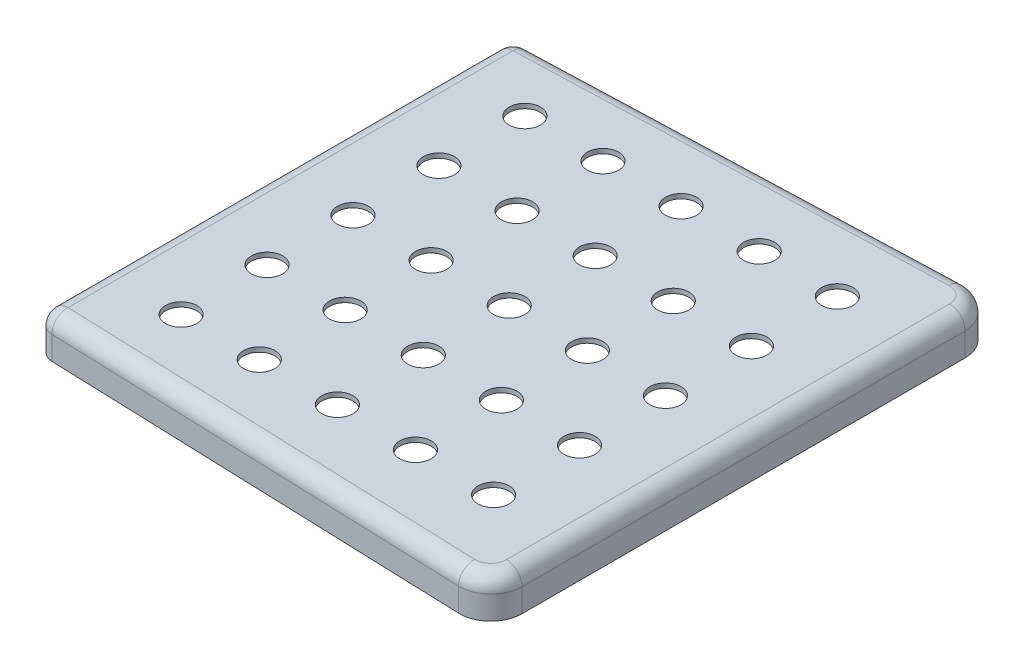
ISO-10303-21;
HEADER;
FILE_DESCRIPTION(('STEP AP214'),'2;1');
FILE_NAME('part.step','',(''),(''),'','','');
FILE_SCHEMA(('AUTOMOTIVE_DESIGN { 1 0 10303 214 1 1 1 1 }'));
ENDSEC;
DATA;
#1=APPLICATION_CONTEXT('core data for automotive mechanical design processes');
#2=APPLICATION_PROTOCOL_DEFINITION('international standard','automotive_design',2000,#1);
#3=PRODUCT_CONTEXT('',#1,'mechanical');
#4=PRODUCT('Part','Part','',(#3));
#5=PRODUCT_RELATED_PRODUCT_CATEGORY('part','',(#4));
#6=PRODUCT_DEFINITION_FORMATION('','',#4);
#7=PRODUCT_DEFINITION_CONTEXT('part definition',#1,'design');
#8=PRODUCT_DEFINITION('design','',#6,#7);
#9=PRODUCT_DEFINITION_SHAPE('','',#8);
#10=(LENGTH_UNIT() NAMED_UNIT(*) SI_UNIT(.MILLI.,.METRE.));
#11=(NAMED_UNIT(*) PLANE_ANGLE_UNIT() SI_UNIT($,.RADIAN.));
#12=(NAMED_UNIT(*) SI_UNIT($,.STERADIAN.) SOLID_ANGLE_UNIT());
#13=UNCERTAINTY_MEASURE_WITH_UNIT(LENGTH_MEASURE(1.E-05),#10,'distance_accuracy_value','');
#14=(GEOMETRIC_REPRESENTATION_CONTEXT(3) GLOBAL_UNCERTAINTY_ASSIGNED_CONTEXT((#13)) GLOBAL_UNIT_ASSIGNED_CONTEXT((#10,
#11,#12)) REPRESENTATION_CONTEXT('',''));
#15=CARTESIAN_POINT('',(0.,0.,0.));
#16=DIRECTION('',(0.,0.,1.));
#17=DIRECTION('',(1.,0.,0.));
#18=AXIS2_PLACEMENT_3D('',#15,#16,#17);
#19=CARTESIAN_POINT('',(150.,-25.0000000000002,-162.5));
#20=DIRECTION('',(1.,0.,0.));
#21=DIRECTION('',(0.,0.,-1.));
#22=AXIS2_PLACEMENT_3D('',#19,#20,#21);
#23=PLANE('',#22);
#24=DIRECTION('',(0.,1.,0.));
#25=VECTOR('',#24,1.);
#26=CARTESIAN_POINT('',(150.,-25.,-141.789393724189));
#27=LINE('',#26,#25);
#28=CARTESIAN_POINT('',(150.,-25.,-141.789393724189));
#29=VERTEX_POINT('',#28);
#30=CARTESIAN_POINT('',(150.,-10.,-141.789393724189));
#31=VERTEX_POINT('',#30);
#32=EDGE_CURVE('E326',#29,#31,#27,.T.);
#33=ORIENTED_EDGE('',*,*,#32,.T.);
#34=DIRECTION('',(0.,0.,-1.));
#35=VECTOR('',#34,1.);
#36=CARTESIAN_POINT('',(150.,-10.0000000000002,-162.5));
#37=LINE('',#36,#35);
#38=CARTESIAN_POINT('',(150.,-10.0000000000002,141.789393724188));
#39=VERTEX_POINT('',#38);
#40=EDGE_CURVE('E361',#31,#39,#37,.F.);
#41=ORIENTED_EDGE('',*,*,#40,.T.);
#42=DIRECTION('',(0.,1.,0.));
#43=VECTOR('',#42,1.);
#44=CARTESIAN_POINT('',(150.,-25.0000000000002,141.789393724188));
#45=LINE('',#44,#43);
#46=CARTESIAN_POINT('',(150.,-25.0000000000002,141.789393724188));
#47=VERTEX_POINT('',#46);
#48=EDGE_CURVE('E329',#39,#47,#45,.F.);
#49=ORIENTED_EDGE('',*,*,#48,.T.);
#50=DIRECTION('',(0.,0.,-1.));
#51=VECTOR('',#50,1.);
#52=CARTESIAN_POINT('',(150.,-25.0000000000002,-162.5));
#53=LINE('',#52,#51);
#54=EDGE_CURVE('E297',#47,#29,#53,.T.);
#55=ORIENTED_EDGE('',*,*,#54,.T.);
#56=EDGE_LOOP('',(#33,#41,#49,#55));
#57=FACE_BOUND('',#56,.T.);
#58=ADVANCED_FACE('F36',(#57),#23,.T.);
#59=CARTESIAN_POINT('',(-150.,-25.,152.023769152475));
#60=DIRECTION('',(-0.0348994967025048,0.,0.999390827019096));
#61=DIRECTION('',(0.999390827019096,0.,0.0348994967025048));
#62=AXIS2_PLACEMENT_3D('',#59,#60,#61);
#63=PLANE('',#62);
#64=DIRECTION('',(0.,1.,0.));
#65=VECTOR('',#64,1.);
#66=CARTESIAN_POINT('',(129.30201006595,-25.,161.77721026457));
#67=LINE('',#66,#65);
#68=CARTESIAN_POINT('',(129.30201006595,-25.,161.77721026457));
#69=VERTEX_POINT('',#68);
#70=CARTESIAN_POINT('',(129.30201006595,-10.0000000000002,161.77721026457));
#71=VERTEX_POINT('',#70);
#72=EDGE_CURVE('E324',#69,#71,#67,.T.);
#73=ORIENTED_EDGE('',*,*,#72,.T.);
#74=DIRECTION('',(0.999390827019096,0.,0.0348994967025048));
#75=VECTOR('',#74,1.);
#76=CARTESIAN_POINT('',(-150.,-10.,152.023769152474));
#77=LINE('',#76,#75);
#78=CARTESIAN_POINT('',(-140.348994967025,-10.,152.360789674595));
#79=VERTEX_POINT('',#78);
#80=EDGE_CURVE('E364',#71,#79,#77,.F.);
#81=ORIENTED_EDGE('',*,*,#80,.T.);
#82=DIRECTION('',(0.,1.,0.));
#83=VECTOR('',#82,1.);
#84=CARTESIAN_POINT('',(-140.348994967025,-25.,152.360789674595));
#85=LINE('',#84,#83);
#86=CARTESIAN_POINT('',(-140.348994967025,-25.,152.360789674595));
#87=VERTEX_POINT('',#86);
#88=EDGE_CURVE('E314',#79,#87,#85,.F.);
#89=ORIENTED_EDGE('',*,*,#88,.T.);
#90=DIRECTION('',(0.999390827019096,0.,0.0348994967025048));
#91=VECTOR('',#90,1.);
#92=CARTESIAN_POINT('',(-150.,-25.,152.023769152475));
#93=LINE('',#92,#91);
#94=EDGE_CURVE('E306',#87,#69,#93,.T.);
#95=ORIENTED_EDGE('',*,*,#94,.T.);
#96=EDGE_LOOP('',(#73,#81,#89,#95));
#97=FACE_BOUND('',#96,.T.);
#98=ADVANCED_FACE('F545',(#97),#63,.T.);
#99=CARTESIAN_POINT('',(-150.,-25.0000000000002,-152.023769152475));
#100=DIRECTION('',(-1.,0.,0.));
#101=DIRECTION('',(0.,0.,1.));
#102=AXIS2_PLACEMENT_3D('',#99,#100,#101);
#103=PLANE('',#102);
#104=DIRECTION('',(0.,1.,0.));
#105=VECTOR('',#104,1.);
#106=CARTESIAN_POINT('',(-150.,-25.0000000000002,142.366881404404));
#107=LINE('',#106,#105);
#108=CARTESIAN_POINT('',(-150.,-25.0000000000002,142.366881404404));
#109=VERTEX_POINT('',#108);
#110=CARTESIAN_POINT('',(-150.,-10.0000000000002,142.366881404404));
#111=VERTEX_POINT('',#110);
#112=EDGE_CURVE('E311',#109,#111,#107,.T.);
#113=ORIENTED_EDGE('',*,*,#112,.T.);
#114=DIRECTION('',(0.,0.,1.));
#115=VECTOR('',#114,1.);
#116=CARTESIAN_POINT('',(-150.,-10.0000000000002,-152.023769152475));
#117=LINE('',#116,#115);
#118=CARTESIAN_POINT('',(-150.,-10.,-142.366881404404));
#119=VERTEX_POINT('',#118);
#120=EDGE_CURVE('E353',#111,#119,#117,.F.);
#121=ORIENTED_EDGE('',*,*,#120,.T.);
#122=DIRECTION('',(0.,1.,0.));
#123=VECTOR('',#122,1.);
#124=CARTESIAN_POINT('',(-150.,-25.,-142.366881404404));
#125=LINE('',#124,#123);
#126=CARTESIAN_POINT('',(-150.,-25.,-142.366881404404));
#127=VERTEX_POINT('',#126);
#128=EDGE_CURVE('E309',#119,#127,#125,.F.);
#129=ORIENTED_EDGE('',*,*,#128,.T.);
#130=DIRECTION('',(0.,0.,1.));
#131=VECTOR('',#130,1.);
#132=CARTESIAN_POINT('',(-150.,-25.0000000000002,-152.023769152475));
#133=LINE('',#132,#131);
#134=EDGE_CURVE('E303',#127,#109,#133,.T.);
#135=ORIENTED_EDGE('',*,*,#134,.T.);
#136=EDGE_LOOP('',(#113,#121,#129,#135));
#137=FACE_BOUND('',#136,.T.);
#138=ADVANCED_FACE('F551',(#137),#103,.T.);
#139=CARTESIAN_POINT('',(-150.,-25.0000000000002,-152.023769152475));
#140=DIRECTION('',(-0.0348994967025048,0.,-0.999390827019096));
#141=DIRECTION('',(-0.999390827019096,0.,0.0348994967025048));
#142=AXIS2_PLACEMENT_3D('',#139,#140,#141);
#143=PLANE('',#142);
#144=DIRECTION('',(0.,1.,0.));
#145=VECTOR('',#144,1.);
#146=CARTESIAN_POINT('',(-140.348994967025,-25.0000000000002,-152.360789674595));
#147=LINE('',#146,#145);
#148=CARTESIAN_POINT('',(-140.348994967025,-25.0000000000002,-152.360789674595));
#149=VERTEX_POINT('',#148);
#150=CARTESIAN_POINT('',(-140.348994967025,-10.0000000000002,-152.360789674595));
#151=VERTEX_POINT('',#150);
#152=EDGE_CURVE('E321',#149,#151,#147,.T.);
#153=ORIENTED_EDGE('',*,*,#152,.T.);
#154=DIRECTION('',(-0.999390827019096,0.,0.0348994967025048));
#155=VECTOR('',#154,1.);
#156=CARTESIAN_POINT('',(-150.,-10.0000000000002,-152.023769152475));
#157=LINE('',#156,#155);
#158=CARTESIAN_POINT('',(129.30201006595,-10.0000000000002,-161.777210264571));
#159=VERTEX_POINT('',#158);
#160=EDGE_CURVE('E357',#151,#159,#157,.F.);
#161=ORIENTED_EDGE('',*,*,#160,.T.);
#162=DIRECTION('',(0.,1.,0.));
#163=VECTOR('',#162,1.);
#164=CARTESIAN_POINT('',(129.30201006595,-25.0000000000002,-161.77721026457));
#165=LINE('',#164,#163);
#166=CARTESIAN_POINT('',(129.30201006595,-25.0000000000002,-161.77721026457));
#167=VERTEX_POINT('',#166);
#168=EDGE_CURVE('E335',#159,#167,#165,.F.);
#169=ORIENTED_EDGE('',*,*,#168,.T.);
#170=DIRECTION('',(-0.999390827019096,0.,0.0348994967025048));
#171=VECTOR('',#170,1.);
#172=CARTESIAN_POINT('',(-150.,-25.0000000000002,-152.023769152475));
#173=LINE('',#172,#171);
#174=EDGE_CURVE('E300',#167,#149,#173,.T.);
#175=ORIENTED_EDGE('',*,*,#174,.T.);
#176=EDGE_LOOP('',(#153,#161,#169,#175));
#177=FACE_BOUND('',#176,.T.);
#178=ADVANCED_FACE('F538',(#177),#143,.T.);
#179=CARTESIAN_POINT('',(150.,-25.,162.5));
#180=DIRECTION('',(0.,1.,0.));
#181=DIRECTION('',(0.,0.,1.));
#182=AXIS2_PLACEMENT_3D('',#179,#180,#181);
#183=PLANE('',#182);
#184=CARTESIAN_POINT('',(130.,-25.0000000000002,141.789393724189));
#185=DIRECTION('',(0.,1.,0.));
#186=DIRECTION('',(0.,0.,1.));
#187=AXIS2_PLACEMENT_3D('',#184,#185,#186);
#188=CIRCLE('',#187,17.);
#189=CARTESIAN_POINT('',(147.,-25.0000000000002,141.789393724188));
#190=VERTEX_POINT('',#189);
#191=CARTESIAN_POINT('',(129.406708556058,-25.,158.779037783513));
#192=VERTEX_POINT('',#191);
#193=EDGE_CURVE('E259',#190,#192,#188,.F.);
#194=ORIENTED_EDGE('',*,*,#193,.F.);
#195=DIRECTION('',(0.,0.,-1.));
#196=VECTOR('',#195,1.);
#197=CARTESIAN_POINT('',(147.,-25.,162.5));
#198=LINE('',#197,#196);
#199=CARTESIAN_POINT('',(147.,-25.,-141.789393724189));
#200=VERTEX_POINT('',#199);
#201=EDGE_CURVE('E206',#190,#200,#198,.T.);
#202=ORIENTED_EDGE('',*,*,#201,.T.);
#203=CARTESIAN_POINT('',(130.,-25.,-141.789393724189));
#204=DIRECTION('',(0.,1.,0.));
#205=DIRECTION('',(0.,0.,1.));
#206=AXIS2_PLACEMENT_3D('',#203,#204,#205);
#207=CIRCLE('',#206,17.);
#208=CARTESIAN_POINT('',(129.406708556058,-25.0000000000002,-158.779037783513));
#209=VERTEX_POINT('',#208);
#210=EDGE_CURVE('E210',#209,#200,#207,.F.);
#211=ORIENTED_EDGE('',*,*,#210,.F.);
#212=DIRECTION('',(-0.999390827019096,0.,0.0348994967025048));
#213=VECTOR('',#212,1.);
#214=CARTESIAN_POINT('',(138.769271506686,-25.0000000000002,-159.105985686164));
#215=LINE('',#214,#213);
#216=CARTESIAN_POINT('',(-140.244296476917,-25.,-149.362617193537));
#217=VERTEX_POINT('',#216);
#218=EDGE_CURVE('E51',#209,#217,#215,.T.);
#219=ORIENTED_EDGE('',*,*,#218,.T.);
#220=CARTESIAN_POINT('',(-140.,-25.,-142.366881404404));
#221=DIRECTION('',(0.,1.,0.));
#222=DIRECTION('',(0.,0.,1.));
#223=AXIS2_PLACEMENT_3D('',#220,#221,#222);
#224=CIRCLE('',#223,7.);
#225=CARTESIAN_POINT('',(-147.,-25.,-142.366881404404));
#226=VERTEX_POINT('',#225);
#227=EDGE_CURVE('E236',#226,#217,#224,.F.);
#228=ORIENTED_EDGE('',*,*,#227,.F.);
#229=DIRECTION('',(0.,0.,1.));
#230=VECTOR('',#229,1.);
#231=CARTESIAN_POINT('',(-147.,-25.,162.5));
#232=LINE('',#231,#230);
#233=CARTESIAN_POINT('',(-147.,-25.0000000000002,142.366881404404));
#234=VERTEX_POINT('',#233);
#235=EDGE_CURVE('E290',#226,#234,#232,.T.);
#236=ORIENTED_EDGE('',*,*,#235,.T.);
#237=CARTESIAN_POINT('',(-140.,-25.0000000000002,142.366881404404));
#238=DIRECTION('',(0.,1.,0.));
#239=DIRECTION('',(0.,0.,1.));
#240=AXIS2_PLACEMENT_3D('',#237,#238,#239);
#241=CIRCLE('',#240,7.);
#242=CARTESIAN_POINT('',(-140.244296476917,-25.0000000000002,149.362617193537));
#243=VERTEX_POINT('',#242);
#244=EDGE_CURVE('E256',#243,#234,#241,.F.);
#245=ORIENTED_EDGE('',*,*,#244,.F.);
#246=DIRECTION('',(0.999390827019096,0.,0.0348994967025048));
#247=VECTOR('',#246,1.);
#248=CARTESIAN_POINT('',(150.104698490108,-25.,159.501827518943));
#249=LINE('',#248,#247);
#250=EDGE_CURVE('E251',#243,#192,#249,.T.);
#251=ORIENTED_EDGE('',*,*,#250,.T.);
#252=EDGE_LOOP('',(#194,#202,#211,#219,#228,#236,#245,#251));
#253=FACE_BOUND('',#252,.T.);
#254=ORIENTED_EDGE('',*,*,#54,.F.);
#255=CARTESIAN_POINT('',(130.,-25.0000000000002,141.789393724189));
#256=DIRECTION('',(0.,1.,0.));
#257=DIRECTION('',(0.,0.,1.));
#258=AXIS2_PLACEMENT_3D('',#255,#256,#257);
#259=CIRCLE('',#258,20.);
#260=EDGE_CURVE('E333',#47,#69,#259,.F.);
#261=ORIENTED_EDGE('',*,*,#260,.T.);
#262=ORIENTED_EDGE('',*,*,#94,.F.);
#263=CARTESIAN_POINT('',(-140.,-25.0000000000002,142.366881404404));
#264=DIRECTION('',(0.,1.,0.));
#265=DIRECTION('',(0.,0.,1.));
#266=AXIS2_PLACEMENT_3D('',#263,#264,#265);
#267=CIRCLE('',#266,10.);
#268=EDGE_CURVE('E319',#87,#109,#267,.F.);
#269=ORIENTED_EDGE('',*,*,#268,.T.);
#270=ORIENTED_EDGE('',*,*,#134,.F.);
#271=CARTESIAN_POINT('',(-140.,-25.,-142.366881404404));
#272=DIRECTION('',(0.,1.,0.));
#273=DIRECTION('',(0.,0.,1.));
#274=AXIS2_PLACEMENT_3D('',#271,#272,#273);
#275=CIRCLE('',#274,10.);
#276=EDGE_CURVE('E316',#127,#149,#275,.F.);
#277=ORIENTED_EDGE('',*,*,#276,.T.);
#278=ORIENTED_EDGE('',*,*,#174,.F.);
#279=CARTESIAN_POINT('',(130.,-25.,-141.789393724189));
#280=DIRECTION('',(0.,1.,0.));
#281=DIRECTION('',(0.,0.,1.));
#282=AXIS2_PLACEMENT_3D('',#279,#280,#281);
#283=CIRCLE('',#282,20.);
#284=EDGE_CURVE('E331',#167,#29,#283,.F.);
#285=ORIENTED_EDGE('',*,*,#284,.T.);
#286=EDGE_LOOP('',(#254,#261,#262,#269,#270,#277,#278,#285));
#287=FACE_BOUND('',#286,.T.);
#288=ADVANCED_FACE('F528',(#253,#287),#183,.F.);
#289=CARTESIAN_POINT('',(150.,0.,162.5));
#290=DIRECTION('',(0.,1.,0.));
#291=DIRECTION('',(0.,0.,1.));
#292=AXIS2_PLACEMENT_3D('',#289,#290,#291);
#293=PLANE('',#292);
#294=CARTESIAN_POINT('',(-50.,0.,-110.));
#295=DIRECTION('',(0.,1.,0.));
#296=DIRECTION('',(0.,0.,1.));
#297=AXIS2_PLACEMENT_3D('',#294,#295,#296);
#298=CIRCLE('',#297,9.99999999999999);
#299=CARTESIAN_POINT('',(-50.,0.,-100.));
#300=VERTEX_POINT('',#299);
#301=EDGE_CURVE('E780',#300,#300,#298,.T.);
#302=ORIENTED_EDGE('',*,*,#301,.F.);
#303=EDGE_LOOP('',(#302));
#304=FACE_BOUND('',#303,.T.);
#305=CARTESIAN_POINT('',(-100.,0.,-110.));
#306=DIRECTION('',(0.,1.,0.));
#307=DIRECTION('',(0.,0.,1.));
#308=AXIS2_PLACEMENT_3D('',#305,#306,#307);
#309=CIRCLE('',#308,9.99999999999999);
#310=CARTESIAN_POINT('',(-100.,0.,-100.));
#311=VERTEX_POINT('',#310);
#312=EDGE_CURVE('E389',#311,#311,#309,.T.);
#313=ORIENTED_EDGE('',*,*,#312,.F.);
#314=EDGE_LOOP('',(#313));
#315=FACE_BOUND('',#314,.T.);
#316=DIRECTION('',(-0.999390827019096,0.,0.0348994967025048));
#317=VECTOR('',#316,1.);
#318=CARTESIAN_POINT('',(139.013567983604,-1.66533453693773E-13,-152.11024989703));
#319=LINE('',#318,#317);
#320=CARTESIAN_POINT('',(129.651005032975,-1.66533453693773E-13,-151.783301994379));
#321=VERTEX_POINT('',#320);
#322=CARTESIAN_POINT('',(-140.,0.,-142.366881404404));
#323=VERTEX_POINT('',#322);
#324=EDGE_CURVE('E348',#321,#323,#319,.T.);
#325=ORIENTED_EDGE('',*,*,#324,.T.);
#326=DIRECTION('',(0.,0.,1.));
#327=VECTOR('',#326,1.);
#328=CARTESIAN_POINT('',(-140.,0.,162.5));
#329=LINE('',#328,#327);
#330=CARTESIAN_POINT('',(-140.,-1.66533453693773E-13,142.366881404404));
#331=VERTEX_POINT('',#330);
#332=EDGE_CURVE('E350',#323,#331,#329,.T.);
#333=ORIENTED_EDGE('',*,*,#332,.T.);
#334=DIRECTION('',(0.999390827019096,0.,0.0348994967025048));
#335=VECTOR('',#334,1.);
#336=CARTESIAN_POINT('',(150.348994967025,0.,152.506091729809));
#337=LINE('',#336,#335);
#338=CARTESIAN_POINT('',(129.651005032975,0.,151.78330199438));
#339=VERTEX_POINT('',#338);
#340=EDGE_CURVE('E340',#331,#339,#337,.T.);
#341=ORIENTED_EDGE('',*,*,#340,.T.);
#342=CARTESIAN_POINT('',(130.,-1.66533453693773E-13,141.789393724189));
#343=DIRECTION('',(0.,1.,0.));
#344=DIRECTION('',(0.,0.,1.));
#345=AXIS2_PLACEMENT_3D('',#342,#343,#344);
#346=CIRCLE('',#345,10.);
#347=CARTESIAN_POINT('',(140.,-1.66533453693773E-13,141.789393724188));
#348=VERTEX_POINT('',#347);
#349=EDGE_CURVE('E342',#339,#348,#346,.T.);
#350=ORIENTED_EDGE('',*,*,#349,.T.);
#351=DIRECTION('',(0.,0.,-1.));
#352=VECTOR('',#351,1.);
#353=CARTESIAN_POINT('',(140.,0.,162.5));
#354=LINE('',#353,#352);
#355=CARTESIAN_POINT('',(140.,0.,-141.789393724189));
#356=VERTEX_POINT('',#355);
#357=EDGE_CURVE('E344',#348,#356,#354,.T.);
#358=ORIENTED_EDGE('',*,*,#357,.T.);
#359=CARTESIAN_POINT('',(130.,0.,-141.789393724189));
#360=DIRECTION('',(0.,1.,0.));
#361=DIRECTION('',(0.,0.,1.));
#362=AXIS2_PLACEMENT_3D('',#359,#360,#361);
#363=CIRCLE('',#362,10.);
#364=EDGE_CURVE('E346',#356,#321,#363,.T.);
#365=ORIENTED_EDGE('',*,*,#364,.T.);
#366=EDGE_LOOP('',(#325,#333,#341,#350,#358,#365));
#367=FACE_BOUND('',#366,.T.);
#368=CARTESIAN_POINT('',(0.,0.,-110.));
#369=DIRECTION('',(0.,1.,0.));
#370=DIRECTION('',(0.,0.,1.));
#371=AXIS2_PLACEMENT_3D('',#368,#369,#370);
#372=CIRCLE('',#371,9.99999999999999);
#373=CARTESIAN_POINT('',(0.,0.,-100.));
#374=VERTEX_POINT('',#373);
#375=EDGE_CURVE('E366',#374,#374,#372,.T.);
#376=ORIENTED_EDGE('',*,*,#375,.F.);
#377=EDGE_LOOP('',(#376));
#378=FACE_BOUND('',#377,.T.);
#379=CARTESIAN_POINT('',(50.,0.,-110.));
#380=DIRECTION('',(0.,1.,0.));
#381=DIRECTION('',(0.,0.,1.));
#382=AXIS2_PLACEMENT_3D('',#379,#380,#381);
#383=CIRCLE('',#382,9.99999999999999);
#384=CARTESIAN_POINT('',(50.,0.,-100.));
#385=VERTEX_POINT('',#384);
#386=EDGE_CURVE('E395',#385,#385,#383,.T.);
#387=ORIENTED_EDGE('',*,*,#386,.F.);
#388=EDGE_LOOP('',(#387));
#389=FACE_BOUND('',#388,.T.);
#390=CARTESIAN_POINT('',(100.,-1.66533453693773E-13,-110.));
#391=DIRECTION('',(0.,1.,0.));
#392=DIRECTION('',(0.,0.,1.));
#393=AXIS2_PLACEMENT_3D('',#390,#391,#392);
#394=CIRCLE('',#393,9.99999999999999);
#395=CARTESIAN_POINT('',(100.,-1.66533453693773E-13,-100.));
#396=VERTEX_POINT('',#395);
#397=EDGE_CURVE('E401',#396,#396,#394,.T.);
#398=ORIENTED_EDGE('',*,*,#397,.F.);
#399=EDGE_LOOP('',(#398));
#400=FACE_BOUND('',#399,.T.);
#401=CARTESIAN_POINT('',(-100.,0.,-55.));
#402=DIRECTION('',(0.,1.,0.));
#403=DIRECTION('',(0.,0.,1.));
#404=AXIS2_PLACEMENT_3D('',#401,#402,#403);
#405=CIRCLE('',#404,9.99999999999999);
#406=CARTESIAN_POINT('',(-100.,0.,-45.));
#407=VERTEX_POINT('',#406);
#408=EDGE_CURVE('E407',#407,#407,#405,.T.);
#409=ORIENTED_EDGE('',*,*,#408,.F.);
#410=EDGE_LOOP('',(#409));
#411=FACE_BOUND('',#410,.T.);
#412=CARTESIAN_POINT('',(-50.,-1.66533453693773E-13,-55.));
#413=DIRECTION('',(0.,1.,0.));
#414=DIRECTION('',(0.,0.,1.));
#415=AXIS2_PLACEMENT_3D('',#412,#413,#414);
#416=CIRCLE('',#415,9.99999999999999);
#417=CARTESIAN_POINT('',(-50.,-1.66533453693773E-13,-45.));
#418=VERTEX_POINT('',#417);
#419=EDGE_CURVE('E413',#418,#418,#416,.T.);
#420=ORIENTED_EDGE('',*,*,#419,.F.);
#421=EDGE_LOOP('',(#420));
#422=FACE_BOUND('',#421,.T.);
#423=CARTESIAN_POINT('',(0.,0.,-55.));
#424=DIRECTION('',(0.,1.,0.));
#425=DIRECTION('',(0.,0.,1.));
#426=AXIS2_PLACEMENT_3D('',#423,#424,#425);
#427=CIRCLE('',#426,9.99999999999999);
#428=CARTESIAN_POINT('',(0.,0.,-45.));
#429=VERTEX_POINT('',#428);
#430=EDGE_CURVE('E419',#429,#429,#427,.T.);
#431=ORIENTED_EDGE('',*,*,#430,.F.);
#432=EDGE_LOOP('',(#431));
#433=FACE_BOUND('',#432,.T.);
#434=CARTESIAN_POINT('',(50.,-1.66533453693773E-13,-55.));
#435=DIRECTION('',(0.,1.,0.));
#436=DIRECTION('',(0.,0.,1.));
#437=AXIS2_PLACEMENT_3D('',#434,#435,#436);
#438=CIRCLE('',#437,9.99999999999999);
#439=CARTESIAN_POINT('',(50.,-1.66533453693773E-13,-45.));
#440=VERTEX_POINT('',#439);
#441=EDGE_CURVE('E425',#440,#440,#438,.T.);
#442=ORIENTED_EDGE('',*,*,#441,.F.);
#443=EDGE_LOOP('',(#442));
#444=FACE_BOUND('',#443,.T.);
#445=CARTESIAN_POINT('',(100.,-1.66533453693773E-13,-55.));
#446=DIRECTION('',(0.,1.,0.));
#447=DIRECTION('',(0.,0.,1.));
#448=AXIS2_PLACEMENT_3D('',#445,#446,#447);
#449=CIRCLE('',#448,9.99999999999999);
#450=CARTESIAN_POINT('',(100.,-1.66533453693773E-13,-45.));
#451=VERTEX_POINT('',#450);
#452=EDGE_CURVE('E431',#451,#451,#449,.T.);
#453=ORIENTED_EDGE('',*,*,#452,.F.);
#454=EDGE_LOOP('',(#453));
#455=FACE_BOUND('',#454,.T.);
#456=CARTESIAN_POINT('',(-100.,0.,0.));
#457=DIRECTION('',(0.,1.,0.));
#458=DIRECTION('',(0.,0.,1.));
#459=AXIS2_PLACEMENT_3D('',#456,#457,#458);
#460=CIRCLE('',#459,9.99999999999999);
#461=CARTESIAN_POINT('',(-100.,0.,9.99999999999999));
#462=VERTEX_POINT('',#461);
#463=EDGE_CURVE('E437',#462,#462,#460,.T.);
#464=ORIENTED_EDGE('',*,*,#463,.F.);
#465=EDGE_LOOP('',(#464));
#466=FACE_BOUND('',#465,.T.);
#467=CARTESIAN_POINT('',(-50.,-1.66533453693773E-13,0.));
#468=DIRECTION('',(0.,1.,0.));
#469=DIRECTION('',(0.,0.,1.));
#470=AXIS2_PLACEMENT_3D('',#467,#468,#469);
#471=CIRCLE('',#470,9.99999999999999);
#472=CARTESIAN_POINT('',(-50.,-1.66533453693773E-13,9.99999999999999));
#473=VERTEX_POINT('',#472);
#474=EDGE_CURVE('E443',#473,#473,#471,.T.);
#475=ORIENTED_EDGE('',*,*,#474,.F.);
#476=EDGE_LOOP('',(#475));
#477=FACE_BOUND('',#476,.T.);
#478=CARTESIAN_POINT('',(0.,0.,0.));
#479=DIRECTION('',(0.,1.,0.));
#480=DIRECTION('',(0.,0.,1.));
#481=AXIS2_PLACEMENT_3D('',#478,#479,#480);
#482=CIRCLE('',#481,9.99999999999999);
#483=CARTESIAN_POINT('',(0.,0.,9.99999999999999));
#484=VERTEX_POINT('',#483);
#485=EDGE_CURVE('E449',#484,#484,#482,.T.);
#486=ORIENTED_EDGE('',*,*,#485,.F.);
#487=EDGE_LOOP('',(#486));
#488=FACE_BOUND('',#487,.T.);
#489=CARTESIAN_POINT('',(50.,0.,0.));
#490=DIRECTION('',(0.,1.,0.));
#491=DIRECTION('',(0.,0.,1.));
#492=AXIS2_PLACEMENT_3D('',#489,#490,#491);
#493=CIRCLE('',#492,9.99999999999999);
#494=CARTESIAN_POINT('',(50.,0.,9.99999999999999));
#495=VERTEX_POINT('',#494);
#496=EDGE_CURVE('E455',#495,#495,#493,.T.);
#497=ORIENTED_EDGE('',*,*,#496,.F.);
#498=EDGE_LOOP('',(#497));
#499=FACE_BOUND('',#498,.T.);
#500=CARTESIAN_POINT('',(100.,-1.66533453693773E-13,0.));
#501=DIRECTION('',(0.,1.,0.));
#502=DIRECTION('',(0.,0.,1.));
#503=AXIS2_PLACEMENT_3D('',#500,#501,#502);
#504=CIRCLE('',#503,9.99999999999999);
#505=CARTESIAN_POINT('',(100.,-1.66533453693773E-13,9.99999999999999));
#506=VERTEX_POINT('',#505);
#507=EDGE_CURVE('E461',#506,#506,#504,.T.);
#508=ORIENTED_EDGE('',*,*,#507,.F.);
#509=EDGE_LOOP('',(#508));
#510=FACE_BOUND('',#509,.T.);
#511=CARTESIAN_POINT('',(-100.,0.,55.));
#512=DIRECTION('',(0.,1.,0.));
#513=DIRECTION('',(0.,0.,1.));
#514=AXIS2_PLACEMENT_3D('',#511,#512,#513);
#515=CIRCLE('',#514,9.99999999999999);
#516=CARTESIAN_POINT('',(-100.,0.,65.));
#517=VERTEX_POINT('',#516);
#518=EDGE_CURVE('E467',#517,#517,#515,.T.);
#519=ORIENTED_EDGE('',*,*,#518,.F.);
#520=EDGE_LOOP('',(#519));
#521=FACE_BOUND('',#520,.T.);
#522=CARTESIAN_POINT('',(-50.,0.,55.));
#523=DIRECTION('',(0.,1.,0.));
#524=DIRECTION('',(0.,0.,1.));
#525=AXIS2_PLACEMENT_3D('',#522,#523,#524);
#526=CIRCLE('',#525,9.99999999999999);
#527=CARTESIAN_POINT('',(-50.,0.,65.));
#528=VERTEX_POINT('',#527);
#529=EDGE_CURVE('E473',#528,#528,#526,.T.);
#530=ORIENTED_EDGE('',*,*,#529,.F.);
#531=EDGE_LOOP('',(#530));
#532=FACE_BOUND('',#531,.T.);
#533=CARTESIAN_POINT('',(0.,0.,55.));
#534=DIRECTION('',(0.,1.,0.));
#535=DIRECTION('',(0.,0.,1.));
#536=AXIS2_PLACEMENT_3D('',#533,#534,#535);
#537=CIRCLE('',#536,9.99999999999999);
#538=CARTESIAN_POINT('',(0.,0.,65.));
#539=VERTEX_POINT('',#538);
#540=EDGE_CURVE('E479',#539,#539,#537,.T.);
#541=ORIENTED_EDGE('',*,*,#540,.F.);
#542=EDGE_LOOP('',(#541));
#543=FACE_BOUND('',#542,.T.);
#544=CARTESIAN_POINT('',(50.,0.,55.));
#545=DIRECTION('',(0.,1.,0.));
#546=DIRECTION('',(0.,0.,1.));
#547=AXIS2_PLACEMENT_3D('',#544,#545,#546);
#548=CIRCLE('',#547,9.99999999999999);
#549=CARTESIAN_POINT('',(50.,0.,65.));
#550=VERTEX_POINT('',#549);
#551=EDGE_CURVE('E485',#550,#550,#548,.T.);
#552=ORIENTED_EDGE('',*,*,#551,.F.);
#553=EDGE_LOOP('',(#552));
#554=FACE_BOUND('',#553,.T.);
#555=CARTESIAN_POINT('',(100.,-1.66533453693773E-13,55.));
#556=DIRECTION('',(0.,1.,0.));
#557=DIRECTION('',(0.,0.,1.));
#558=AXIS2_PLACEMENT_3D('',#555,#556,#557);
#559=CIRCLE('',#558,9.99999999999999);
#560=CARTESIAN_POINT('',(100.,-1.66533453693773E-13,65.));
#561=VERTEX_POINT('',#560);
#562=EDGE_CURVE('E491',#561,#561,#559,.T.);
#563=ORIENTED_EDGE('',*,*,#562,.F.);
#564=EDGE_LOOP('',(#563));
#565=FACE_BOUND('',#564,.T.);
#566=CARTESIAN_POINT('',(-100.,0.,110.));
#567=DIRECTION('',(0.,1.,0.));
#568=DIRECTION('',(0.,0.,1.));
#569=AXIS2_PLACEMENT_3D('',#566,#567,#568);
#570=CIRCLE('',#569,9.99999999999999);
#571=CARTESIAN_POINT('',(-100.,0.,120.));
#572=VERTEX_POINT('',#571);
#573=EDGE_CURVE('E497',#572,#572,#570,.T.);
#574=ORIENTED_EDGE('',*,*,#573,.F.);
#575=EDGE_LOOP('',(#574));
#576=FACE_BOUND('',#575,.T.);
#577=CARTESIAN_POINT('',(-50.,-1.66533453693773E-13,110.));
#578=DIRECTION('',(0.,1.,0.));
#579=DIRECTION('',(0.,0.,1.));
#580=AXIS2_PLACEMENT_3D('',#577,#578,#579);
#581=CIRCLE('',#580,9.99999999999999);
#582=CARTESIAN_POINT('',(-50.,-1.66533453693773E-13,120.));
#583=VERTEX_POINT('',#582);
#584=EDGE_CURVE('E503',#583,#583,#581,.T.);
#585=ORIENTED_EDGE('',*,*,#584,.F.);
#586=EDGE_LOOP('',(#585));
#587=FACE_BOUND('',#586,.T.);
#588=CARTESIAN_POINT('',(0.,0.,110.));
#589=DIRECTION('',(0.,1.,0.));
#590=DIRECTION('',(0.,0.,1.));
#591=AXIS2_PLACEMENT_3D('',#588,#589,#590);
#592=CIRCLE('',#591,9.99999999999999);
#593=CARTESIAN_POINT('',(0.,0.,120.));
#594=VERTEX_POINT('',#593);
#595=EDGE_CURVE('E509',#594,#594,#592,.T.);
#596=ORIENTED_EDGE('',*,*,#595,.F.);
#597=EDGE_LOOP('',(#596));
#598=FACE_BOUND('',#597,.T.);
#599=CARTESIAN_POINT('',(50.,-1.66533453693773E-13,110.));
#600=DIRECTION('',(0.,1.,0.));
#601=DIRECTION('',(0.,0.,1.));
#602=AXIS2_PLACEMENT_3D('',#599,#600,#601);
#603=CIRCLE('',#602,9.99999999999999);
#604=CARTESIAN_POINT('',(50.,-1.66533453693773E-13,120.));
#605=VERTEX_POINT('',#604);
#606=EDGE_CURVE('E515',#605,#605,#603,.T.);
#607=ORIENTED_EDGE('',*,*,#606,.F.);
#608=EDGE_LOOP('',(#607));
#609=FACE_BOUND('',#608,.T.);
#610=CARTESIAN_POINT('',(100.,-1.66533453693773E-13,110.));
#611=DIRECTION('',(0.,1.,0.));
#612=DIRECTION('',(0.,0.,1.));
#613=AXIS2_PLACEMENT_3D('',#610,#611,#612);
#614=CIRCLE('',#613,9.99999999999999);
#615=CARTESIAN_POINT('',(100.,-1.66533453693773E-13,120.));
#616=VERTEX_POINT('',#615);
#617=EDGE_CURVE('E44',#616,#616,#614,.T.);
#618=ORIENTED_EDGE('',*,*,#617,.F.);
#619=EDGE_LOOP('',(#618));
#620=FACE_BOUND('',#619,.T.);
#621=ADVANCED_FACE('F525',(#304,#315,#367,#378,#389,#400,#411,#422,#433,#444,#455,#466,#477,
#488,#499,#510,#521,#532,#543,#554,#565,#576,#587,#598,#609,#620),#293,.T.);
#622=CARTESIAN_POINT('',(-140.,-25.0000000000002,142.366881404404));
#623=DIRECTION('',(0.,1.,0.));
#624=DIRECTION('',(0.,0.,1.));
#625=AXIS2_PLACEMENT_3D('',#622,#623,#624);
#626=CYLINDRICAL_SURFACE('',#625,10.);
#627=ORIENTED_EDGE('',*,*,#88,.F.);
#628=CARTESIAN_POINT('',(-140.,-10.0000000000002,142.366881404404));
#629=DIRECTION('',(0.,1.,0.));
#630=DIRECTION('',(0.,0.,1.));
#631=AXIS2_PLACEMENT_3D('',#628,#629,#630);
#632=CIRCLE('',#631,10.);
#633=EDGE_CURVE('E337',#79,#111,#632,.F.);
#634=ORIENTED_EDGE('',*,*,#633,.T.);
#635=ORIENTED_EDGE('',*,*,#112,.F.);
#636=ORIENTED_EDGE('',*,*,#268,.F.);
#637=EDGE_LOOP('',(#627,#634,#635,#636));
#638=FACE_BOUND('',#637,.T.);
#639=ADVANCED_FACE('F527',(#638),#626,.T.);
#640=CARTESIAN_POINT('',(-140.,-25.,-142.366881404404));
#641=DIRECTION('',(0.,1.,0.));
#642=DIRECTION('',(0.,0.,1.));
#643=AXIS2_PLACEMENT_3D('',#640,#641,#642);
#644=CYLINDRICAL_SURFACE('',#643,10.);
#645=ORIENTED_EDGE('',*,*,#128,.F.);
#646=CARTESIAN_POINT('',(-140.,-10.,-142.366881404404));
#647=DIRECTION('',(0.,1.,0.));
#648=DIRECTION('',(0.,0.,1.));
#649=AXIS2_PLACEMENT_3D('',#646,#647,#648);
#650=CIRCLE('',#649,10.);
#651=EDGE_CURVE('E355',#119,#151,#650,.F.);
#652=ORIENTED_EDGE('',*,*,#651,.T.);
#653=ORIENTED_EDGE('',*,*,#152,.F.);
#654=ORIENTED_EDGE('',*,*,#276,.F.);
#655=EDGE_LOOP('',(#645,#652,#653,#654));
#656=FACE_BOUND('',#655,.T.);
#657=ADVANCED_FACE('F535',(#656),#644,.T.);
#658=CARTESIAN_POINT('',(130.,-25.0000000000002,141.789393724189));
#659=DIRECTION('',(0.,1.,0.));
#660=DIRECTION('',(0.,0.,1.));
#661=AXIS2_PLACEMENT_3D('',#658,#659,#660);
#662=CYLINDRICAL_SURFACE('',#661,20.);
#663=ORIENTED_EDGE('',*,*,#48,.F.);
#664=CARTESIAN_POINT('',(130.,-10.0000000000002,141.789393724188));
#665=DIRECTION('',(0.,1.,0.));
#666=DIRECTION('',(0.,0.,1.));
#667=AXIS2_PLACEMENT_3D('',#664,#665,#666);
#668=CIRCLE('',#667,20.);
#669=EDGE_CURVE('E59',#39,#71,#668,.F.);
#670=ORIENTED_EDGE('',*,*,#669,.T.);
#671=ORIENTED_EDGE('',*,*,#72,.F.);
#672=ORIENTED_EDGE('',*,*,#260,.F.);
#673=EDGE_LOOP('',(#663,#670,#671,#672));
#674=FACE_BOUND('',#673,.T.);
#675=ADVANCED_FACE('F558',(#674),#662,.T.);
#676=CARTESIAN_POINT('',(130.,-25.,-141.789393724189));
#677=DIRECTION('',(0.,1.,0.));
#678=DIRECTION('',(0.,0.,1.));
#679=AXIS2_PLACEMENT_3D('',#676,#677,#678);
#680=CYLINDRICAL_SURFACE('',#679,20.);
#681=ORIENTED_EDGE('',*,*,#168,.F.);
#682=CARTESIAN_POINT('',(130.,-10.,-141.789393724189));
#683=DIRECTION('',(0.,1.,0.));
#684=DIRECTION('',(0.,0.,1.));
#685=AXIS2_PLACEMENT_3D('',#682,#683,#684);
#686=CIRCLE('',#685,20.);
#687=EDGE_CURVE('E359',#159,#31,#686,.F.);
#688=ORIENTED_EDGE('',*,*,#687,.T.);
#689=ORIENTED_EDGE('',*,*,#32,.F.);
#690=ORIENTED_EDGE('',*,*,#284,.F.);
#691=EDGE_LOOP('',(#681,#688,#689,#690));
#692=FACE_BOUND('',#691,.T.);
#693=ADVANCED_FACE('F562',(#692),#680,.T.);
#694=CARTESIAN_POINT('',(130.,-10.,-141.789393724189));
#695=DIRECTION('',(0.,1.,0.));
#696=DIRECTION('',(0.,0.,1.));
#697=AXIS2_PLACEMENT_3D('',#694,#695,#696);
#698=DEGENERATE_TOROIDAL_SURFACE('',#697,10.,10.,.T.);
#699=CARTESIAN_POINT('',(140.,-10.,-141.789393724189));
#700=DIRECTION('',(0.,0.,1.));
#701=DIRECTION('',(1.,0.,0.));
#702=AXIS2_PLACEMENT_3D('',#699,#700,#701);
#703=CIRCLE('',#702,10.);
#704=EDGE_CURVE('E382',#31,#356,#703,.T.);
#705=ORIENTED_EDGE('',*,*,#704,.F.);
#706=ORIENTED_EDGE('',*,*,#687,.F.);
#707=CARTESIAN_POINT('',(129.651005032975,-10.0000000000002,-151.78330199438));
#708=DIRECTION('',(-0.999390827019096,0.,0.0348994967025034));
#709=DIRECTION('',(0.0348994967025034,0.,0.999390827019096));
#710=AXIS2_PLACEMENT_3D('',#707,#708,#709);
#711=CIRCLE('',#710,10.);
#712=EDGE_CURVE('E301',#321,#159,#711,.T.);
#713=ORIENTED_EDGE('',*,*,#712,.F.);
#714=ORIENTED_EDGE('',*,*,#364,.F.);
#715=EDGE_LOOP('',(#705,#706,#713,#714));
#716=FACE_BOUND('',#715,.T.);
#717=ADVANCED_FACE('F565',(#716),#698,.T.);
#718=CARTESIAN_POINT('',(139.013567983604,-10.0000000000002,-152.11024989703));
#719=DIRECTION('',(-0.999390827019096,0.,0.0348994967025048));
#720=DIRECTION('',(0.0348994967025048,0.,0.999390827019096));
#721=AXIS2_PLACEMENT_3D('',#718,#719,#720);
#722=CYLINDRICAL_SURFACE('',#721,10.);
#723=ORIENTED_EDGE('',*,*,#712,.T.);
#724=ORIENTED_EDGE('',*,*,#160,.F.);
#725=CARTESIAN_POINT('',(-140.,-10.,-142.366881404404));
#726=DIRECTION('',(-0.999390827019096,0.,0.0348994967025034));
#727=DIRECTION('',(0.0348994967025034,0.,0.999390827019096));
#728=AXIS2_PLACEMENT_3D('',#725,#726,#727);
#729=CIRCLE('',#728,10.);
#730=EDGE_CURVE('E379',#323,#151,#729,.T.);
#731=ORIENTED_EDGE('',*,*,#730,.F.);
#732=ORIENTED_EDGE('',*,*,#324,.F.);
#733=EDGE_LOOP('',(#723,#724,#731,#732));
#734=FACE_BOUND('',#733,.T.);
#735=ADVANCED_FACE('F590',(#734),#722,.T.);
#736=CARTESIAN_POINT('',(140.,-10.,162.5));
#737=DIRECTION('',(0.,0.,-1.));
#738=DIRECTION('',(-1.,0.,0.));
#739=AXIS2_PLACEMENT_3D('',#736,#737,#738);
#740=CYLINDRICAL_SURFACE('',#739,10.);
#741=ORIENTED_EDGE('',*,*,#704,.T.);
#742=ORIENTED_EDGE('',*,*,#357,.F.);
#743=CARTESIAN_POINT('',(140.,-10.0000000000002,141.789393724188));
#744=DIRECTION('',(0.,0.,1.));
#745=DIRECTION('',(1.,0.,0.));
#746=AXIS2_PLACEMENT_3D('',#743,#744,#745);
#747=CIRCLE('',#746,10.);
#748=EDGE_CURVE('E376',#39,#348,#747,.T.);
#749=ORIENTED_EDGE('',*,*,#748,.F.);
#750=ORIENTED_EDGE('',*,*,#40,.F.);
#751=EDGE_LOOP('',(#741,#742,#749,#750));
#752=FACE_BOUND('',#751,.T.);
#753=ADVANCED_FACE('F586',(#752),#740,.T.);
#754=CARTESIAN_POINT('',(-140.,-10.,-142.366881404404));
#755=DIRECTION('',(0.,0.,1.));
#756=DIRECTION('',(1.,0.,0.));
#757=AXIS2_PLACEMENT_3D('',#754,#755,#756);
#758=SPHERICAL_SURFACE('',#757,10.);
#759=ORIENTED_EDGE('',*,*,#730,.T.);
#760=ORIENTED_EDGE('',*,*,#651,.F.);
#761=CARTESIAN_POINT('',(-140.,-10.,-142.366881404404));
#762=DIRECTION('',(0.,0.,1.));
#763=DIRECTION('',(1.,0.,0.));
#764=AXIS2_PLACEMENT_3D('',#761,#762,#763);
#765=CIRCLE('',#764,10.);
#766=EDGE_CURVE('E373',#323,#119,#765,.T.);
#767=ORIENTED_EDGE('',*,*,#766,.F.);
#768=EDGE_LOOP('',(#759,#760,#767));
#769=FACE_BOUND('',#768,.T.);
#770=ADVANCED_FACE('F582',(#769),#758,.T.);
#771=CARTESIAN_POINT('',(130.,-10.0000000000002,141.789393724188));
#772=DIRECTION('',(0.,1.,0.));
#773=DIRECTION('',(0.,0.,1.));
#774=AXIS2_PLACEMENT_3D('',#771,#772,#773);
#775=DEGENERATE_TOROIDAL_SURFACE('',#774,10.,10.,.T.);
#776=ORIENTED_EDGE('',*,*,#748,.T.);
#777=ORIENTED_EDGE('',*,*,#349,.F.);
#778=CARTESIAN_POINT('',(129.651005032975,-10.,151.783301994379));
#779=DIRECTION('',(-0.999390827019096,0.,-0.0348994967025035));
#780=DIRECTION('',(-0.0348994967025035,0.,0.999390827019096));
#781=AXIS2_PLACEMENT_3D('',#778,#779,#780);
#782=CIRCLE('',#781,10.);
#783=EDGE_CURVE('E370',#71,#339,#782,.T.);
#784=ORIENTED_EDGE('',*,*,#783,.F.);
#785=ORIENTED_EDGE('',*,*,#669,.F.);
#786=EDGE_LOOP('',(#776,#777,#784,#785));
#787=FACE_BOUND('',#786,.T.);
#788=ADVANCED_FACE('F578',(#787),#775,.T.);
#789=CARTESIAN_POINT('',(-140.,-10.,162.5));
#790=DIRECTION('',(0.,0.,1.));
#791=DIRECTION('',(1.,0.,0.));
#792=AXIS2_PLACEMENT_3D('',#789,#790,#791);
#793=CYLINDRICAL_SURFACE('',#792,10.);
#794=ORIENTED_EDGE('',*,*,#766,.T.);
#795=ORIENTED_EDGE('',*,*,#120,.F.);
#796=CARTESIAN_POINT('',(-140.,-10.0000000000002,142.366881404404));
#797=DIRECTION('',(0.,0.,1.));
#798=DIRECTION('',(1.,0.,0.));
#799=AXIS2_PLACEMENT_3D('',#796,#797,#798);
#800=CIRCLE('',#799,10.);
#801=EDGE_CURVE('E368',#331,#111,#800,.T.);
#802=ORIENTED_EDGE('',*,*,#801,.F.);
#803=ORIENTED_EDGE('',*,*,#332,.F.);
#804=EDGE_LOOP('',(#794,#795,#802,#803));
#805=FACE_BOUND('',#804,.T.);
#806=ADVANCED_FACE('F574',(#805),#793,.T.);
#807=CARTESIAN_POINT('',(150.348994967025,-10.,152.506091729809));
#808=DIRECTION('',(0.999390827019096,0.,0.0348994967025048));
#809=DIRECTION('',(0.0348994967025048,0.,-0.999390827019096));
#810=AXIS2_PLACEMENT_3D('',#807,#808,#809);
#811=CYLINDRICAL_SURFACE('',#810,10.);
#812=ORIENTED_EDGE('',*,*,#783,.T.);
#813=ORIENTED_EDGE('',*,*,#340,.F.);
#814=CARTESIAN_POINT('',(-140.,-10.0000000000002,142.366881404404));
#815=DIRECTION('',(-0.999390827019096,0.,-0.0348994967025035));
#816=DIRECTION('',(-0.0348994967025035,0.,0.999390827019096));
#817=AXIS2_PLACEMENT_3D('',#814,#815,#816);
#818=CIRCLE('',#817,10.);
#819=EDGE_CURVE('E229',#79,#331,#818,.T.);
#820=ORIENTED_EDGE('',*,*,#819,.F.);
#821=ORIENTED_EDGE('',*,*,#80,.F.);
#822=EDGE_LOOP('',(#812,#813,#820,#821));
#823=FACE_BOUND('',#822,.T.);
#824=ADVANCED_FACE('F570',(#823),#811,.T.);
#825=CARTESIAN_POINT('',(-140.,-10.0000000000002,142.366881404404));
#826=DIRECTION('',(0.,0.,1.));
#827=DIRECTION('',(1.,0.,0.));
#828=AXIS2_PLACEMENT_3D('',#825,#826,#827);
#829=SPHERICAL_SURFACE('',#828,10.);
#830=ORIENTED_EDGE('',*,*,#801,.T.);
#831=ORIENTED_EDGE('',*,*,#633,.F.);
#832=ORIENTED_EDGE('',*,*,#819,.T.);
#833=EDGE_LOOP('',(#830,#831,#832));
#834=FACE_BOUND('',#833,.T.);
#835=ADVANCED_FACE('F567',(#834),#829,.T.);
#836=CARTESIAN_POINT('',(147.,-25.0000000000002,-162.5));
#837=DIRECTION('',(1.,0.,0.));
#838=DIRECTION('',(0.,0.,-1.));
#839=AXIS2_PLACEMENT_3D('',#836,#837,#838);
#840=PLANE('',#839);
#841=DIRECTION('',(0.,1.,0.));
#842=VECTOR('',#841,1.);
#843=CARTESIAN_POINT('',(147.,-25.,-141.789393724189));
#844=LINE('',#843,#842);
#845=CARTESIAN_POINT('',(147.,-10.,-141.789393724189));
#846=VERTEX_POINT('',#845);
#847=EDGE_CURVE('E211',#200,#846,#844,.T.);
#848=ORIENTED_EDGE('',*,*,#847,.F.);
#849=ORIENTED_EDGE('',*,*,#201,.F.);
#850=DIRECTION('',(0.,1.,0.));
#851=VECTOR('',#850,1.);
#852=CARTESIAN_POINT('',(147.,-25.0000000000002,141.789393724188));
#853=LINE('',#852,#851);
#854=CARTESIAN_POINT('',(147.,-10.0000000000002,141.789393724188));
#855=VERTEX_POINT('',#854);
#856=EDGE_CURVE('E203',#855,#190,#853,.F.);
#857=ORIENTED_EDGE('',*,*,#856,.F.);
#858=DIRECTION('',(0.,0.,-1.));
#859=VECTOR('',#858,1.);
#860=CARTESIAN_POINT('',(147.,-10.0000000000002,-162.5));
#861=LINE('',#860,#859);
#862=EDGE_CURVE('E190',#846,#855,#861,.F.);
#863=ORIENTED_EDGE('',*,*,#862,.F.);
#864=EDGE_LOOP('',(#848,#849,#857,#863));
#865=FACE_BOUND('',#864,.T.);
#866=ADVANCED_FACE('F204',(#865),#840,.F.);
#867=CARTESIAN_POINT('',(-149.895301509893,-25.0000000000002,149.025596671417));
#868=DIRECTION('',(-0.0348994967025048,0.,0.999390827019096));
#869=DIRECTION('',(0.999390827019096,0.,0.0348994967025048));
#870=AXIS2_PLACEMENT_3D('',#867,#868,#869);
#871=PLANE('',#870);
#872=DIRECTION('',(0.,1.,0.));
#873=VECTOR('',#872,1.);
#874=CARTESIAN_POINT('',(129.406708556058,-25.,158.779037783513));
#875=LINE('',#874,#873);
#876=CARTESIAN_POINT('',(129.406708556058,-10.,158.779037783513));
#877=VERTEX_POINT('',#876);
#878=EDGE_CURVE('E225',#192,#877,#875,.T.);
#879=ORIENTED_EDGE('',*,*,#878,.F.);
#880=ORIENTED_EDGE('',*,*,#250,.F.);
#881=DIRECTION('',(0.,1.,0.));
#882=VECTOR('',#881,1.);
#883=CARTESIAN_POINT('',(-140.244296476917,-25.0000000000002,149.362617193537));
#884=LINE('',#883,#882);
#885=CARTESIAN_POINT('',(-140.244296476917,-10.0000000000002,149.362617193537));
#886=VERTEX_POINT('',#885);
#887=EDGE_CURVE('E234',#886,#243,#884,.F.);
#888=ORIENTED_EDGE('',*,*,#887,.F.);
#889=DIRECTION('',(0.999390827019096,0.,0.0348994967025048));
#890=VECTOR('',#889,1.);
#891=CARTESIAN_POINT('',(-149.895301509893,-10.0000000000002,149.025596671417));
#892=LINE('',#891,#890);
#893=EDGE_CURVE('E227',#877,#886,#892,.F.);
#894=ORIENTED_EDGE('',*,*,#893,.F.);
#895=EDGE_LOOP('',(#879,#880,#888,#894));
#896=FACE_BOUND('',#895,.T.);
#897=ADVANCED_FACE('F792',(#896),#871,.F.);
#898=CARTESIAN_POINT('',(-147.,-25.0000000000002,-152.023769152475));
#899=DIRECTION('',(-1.,0.,0.));
#900=DIRECTION('',(0.,0.,1.));
#901=AXIS2_PLACEMENT_3D('',#898,#899,#900);
#902=PLANE('',#901);
#903=DIRECTION('',(0.,1.,0.));
#904=VECTOR('',#903,1.);
#905=CARTESIAN_POINT('',(-147.,-25.0000000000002,142.366881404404));
#906=LINE('',#905,#904);
#907=CARTESIAN_POINT('',(-147.,-10.0000000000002,142.366881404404));
#908=VERTEX_POINT('',#907);
#909=EDGE_CURVE('E237',#234,#908,#906,.T.);
#910=ORIENTED_EDGE('',*,*,#909,.F.);
#911=ORIENTED_EDGE('',*,*,#235,.F.);
#912=DIRECTION('',(0.,1.,0.));
#913=VECTOR('',#912,1.);
#914=CARTESIAN_POINT('',(-147.,-25.,-142.366881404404));
#915=LINE('',#914,#913);
#916=CARTESIAN_POINT('',(-147.,-10.,-142.366881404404));
#917=VERTEX_POINT('',#916);
#918=EDGE_CURVE('E245',#917,#226,#915,.F.);
#919=ORIENTED_EDGE('',*,*,#918,.F.);
#920=DIRECTION('',(0.,0.,1.));
#921=VECTOR('',#920,1.);
#922=CARTESIAN_POINT('',(-147.,-10.0000000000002,-152.023769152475));
#923=LINE('',#922,#921);
#924=EDGE_CURVE('E246',#908,#917,#923,.F.);
#925=ORIENTED_EDGE('',*,*,#924,.F.);
#926=EDGE_LOOP('',(#910,#911,#919,#925));
#927=FACE_BOUND('',#926,.T.);
#928=ADVANCED_FACE('F707',(#927),#902,.F.);
#929=CARTESIAN_POINT('',(-149.895301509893,-25.,-149.025596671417));
#930=DIRECTION('',(-0.0348994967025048,0.,-0.999390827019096));
#931=DIRECTION('',(-0.999390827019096,0.,0.0348994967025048));
#932=AXIS2_PLACEMENT_3D('',#929,#930,#931);
#933=PLANE('',#932);
#934=DIRECTION('',(0.,1.,0.));
#935=VECTOR('',#934,1.);
#936=CARTESIAN_POINT('',(-140.244296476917,-25.,-149.362617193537));
#937=LINE('',#936,#935);
#938=CARTESIAN_POINT('',(-140.244296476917,-10.,-149.362617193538));
#939=VERTEX_POINT('',#938);
#940=EDGE_CURVE('E232',#217,#939,#937,.T.);
#941=ORIENTED_EDGE('',*,*,#940,.F.);
#942=ORIENTED_EDGE('',*,*,#218,.F.);
#943=DIRECTION('',(0.,1.,0.));
#944=VECTOR('',#943,1.);
#945=CARTESIAN_POINT('',(129.406708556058,-25.0000000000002,-158.779037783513));
#946=LINE('',#945,#944);
#947=CARTESIAN_POINT('',(129.406708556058,-10.0000000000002,-158.779037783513));
#948=VERTEX_POINT('',#947);
#949=EDGE_CURVE('E242',#948,#209,#946,.F.);
#950=ORIENTED_EDGE('',*,*,#949,.F.);
#951=DIRECTION('',(-0.999390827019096,0.,0.0348994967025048));
#952=VECTOR('',#951,1.);
#953=CARTESIAN_POINT('',(-149.895301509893,-10.,-149.025596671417));
#954=LINE('',#953,#952);
#955=EDGE_CURVE('E253',#939,#948,#954,.F.);
#956=ORIENTED_EDGE('',*,*,#955,.F.);
#957=EDGE_LOOP('',(#941,#942,#950,#956));
#958=FACE_BOUND('',#957,.T.);
#959=ADVANCED_FACE('F696',(#958),#933,.F.);
#960=CARTESIAN_POINT('',(150.,-3.,162.5));
#961=DIRECTION('',(0.,1.,0.));
#962=DIRECTION('',(0.,0.,1.));
#963=AXIS2_PLACEMENT_3D('',#960,#961,#962);
#964=PLANE('',#963);
#965=CARTESIAN_POINT('',(-50.,-3.,-110.));
#966=DIRECTION('',(0.,1.,0.));
#967=DIRECTION('',(0.,0.,1.));
#968=AXIS2_PLACEMENT_3D('',#965,#966,#967);
#969=CIRCLE('',#968,9.99999999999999);
#970=CARTESIAN_POINT('',(-50.,-3.,-100.));
#971=VERTEX_POINT('',#970);
#972=EDGE_CURVE('E778',#971,#971,#969,.T.);
#973=ORIENTED_EDGE('',*,*,#972,.T.);
#974=EDGE_LOOP('',(#973));
#975=FACE_BOUND('',#974,.T.);
#976=CARTESIAN_POINT('',(-100.,-3.,-110.));
#977=DIRECTION('',(0.,1.,0.));
#978=DIRECTION('',(0.,0.,1.));
#979=AXIS2_PLACEMENT_3D('',#976,#977,#978);
#980=CIRCLE('',#979,9.99999999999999);
#981=CARTESIAN_POINT('',(-100.,-3.,-100.));
#982=VERTEX_POINT('',#981);
#983=EDGE_CURVE('E284',#982,#982,#980,.T.);
#984=ORIENTED_EDGE('',*,*,#983,.T.);
#985=EDGE_LOOP('',(#984));
#986=FACE_BOUND('',#985,.T.);
#987=DIRECTION('',(-0.999390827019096,0.,0.0348994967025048));
#988=VECTOR('',#987,1.);
#989=CARTESIAN_POINT('',(139.013567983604,-3.00000000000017,-152.11024989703));
#990=LINE('',#989,#988);
#991=CARTESIAN_POINT('',(129.651005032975,-3.00000000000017,-151.783301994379));
#992=VERTEX_POINT('',#991);
#993=CARTESIAN_POINT('',(-140.,-3.,-142.366881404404));
#994=VERTEX_POINT('',#993);
#995=EDGE_CURVE('E267',#992,#994,#990,.T.);
#996=ORIENTED_EDGE('',*,*,#995,.F.);
#997=CARTESIAN_POINT('',(130.,-3.,-141.789393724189));
#998=DIRECTION('',(0.,1.,0.));
#999=DIRECTION('',(0.,0.,1.));
#1000=AXIS2_PLACEMENT_3D('',#997,#998,#999);
#1001=CIRCLE('',#1000,10.);
#1002=CARTESIAN_POINT('',(140.,-3.,-141.789393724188));
#1003=VERTEX_POINT('',#1002);
#1004=EDGE_CURVE('E265',#1003,#992,#1001,.T.);
#1005=ORIENTED_EDGE('',*,*,#1004,.F.);
#1006=DIRECTION('',(0.,0.,1.));
#1007=VECTOR('',#1006,1.);
#1008=CARTESIAN_POINT('',(140.,-3.,162.5));
#1009=LINE('',#1008,#1007);
#1010=CARTESIAN_POINT('',(140.,-3.00000000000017,141.789393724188));
#1011=VERTEX_POINT('',#1010);
#1012=EDGE_CURVE('E268',#1011,#1003,#1009,.F.);
#1013=ORIENTED_EDGE('',*,*,#1012,.F.);
#1014=CARTESIAN_POINT('',(130.,-3.00000000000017,141.789393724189));
#1015=DIRECTION('',(0.,1.,0.));
#1016=DIRECTION('',(0.,0.,1.));
#1017=AXIS2_PLACEMENT_3D('',#1014,#1015,#1016);
#1018=CIRCLE('',#1017,10.);
#1019=CARTESIAN_POINT('',(129.651005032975,-3.,151.78330199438));
#1020=VERTEX_POINT('',#1019);
#1021=EDGE_CURVE('E218',#1020,#1011,#1018,.T.);
#1022=ORIENTED_EDGE('',*,*,#1021,.F.);
#1023=DIRECTION('',(0.999390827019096,0.,0.0348994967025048));
#1024=VECTOR('',#1023,1.);
#1025=CARTESIAN_POINT('',(150.348994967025,-3.,152.506091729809));
#1026=LINE('',#1025,#1024);
#1027=CARTESIAN_POINT('',(-140.,-3.00000000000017,142.366881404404));
#1028=VERTEX_POINT('',#1027);
#1029=EDGE_CURVE('E241',#1028,#1020,#1026,.T.);
#1030=ORIENTED_EDGE('',*,*,#1029,.F.);
#1031=DIRECTION('',(0.,0.,1.));
#1032=VECTOR('',#1031,1.);
#1033=CARTESIAN_POINT('',(-140.,-3.,162.5));
#1034=LINE('',#1033,#1032);
#1035=EDGE_CURVE('E249',#994,#1028,#1034,.T.);
#1036=ORIENTED_EDGE('',*,*,#1035,.F.);
#1037=EDGE_LOOP('',(#996,#1005,#1013,#1022,#1030,#1036));
#1038=FACE_BOUND('',#1037,.T.);
#1039=CARTESIAN_POINT('',(0.,-3.,-110.));
#1040=DIRECTION('',(0.,1.,0.));
#1041=DIRECTION('',(0.,0.,1.));
#1042=AXIS2_PLACEMENT_3D('',#1039,#1040,#1041);
#1043=CIRCLE('',#1042,9.99999999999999);
#1044=CARTESIAN_POINT('',(0.,-3.,-100.));
#1045=VERTEX_POINT('',#1044);
#1046=EDGE_CURVE('E392',#1045,#1045,#1043,.T.);
#1047=ORIENTED_EDGE('',*,*,#1046,.T.);
#1048=EDGE_LOOP('',(#1047));
#1049=FACE_BOUND('',#1048,.T.);
#1050=CARTESIAN_POINT('',(50.,-3.,-110.));
#1051=DIRECTION('',(0.,1.,0.));
#1052=DIRECTION('',(0.,0.,1.));
#1053=AXIS2_PLACEMENT_3D('',#1050,#1051,#1052);
#1054=CIRCLE('',#1053,9.99999999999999);
#1055=CARTESIAN_POINT('',(50.,-3.,-100.));
#1056=VERTEX_POINT('',#1055);
#1057=EDGE_CURVE('E398',#1056,#1056,#1054,.T.);
#1058=ORIENTED_EDGE('',*,*,#1057,.T.);
#1059=EDGE_LOOP('',(#1058));
#1060=FACE_BOUND('',#1059,.T.);
#1061=CARTESIAN_POINT('',(100.,-3.00000000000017,-110.));
#1062=DIRECTION('',(0.,1.,0.));
#1063=DIRECTION('',(0.,0.,1.));
#1064=AXIS2_PLACEMENT_3D('',#1061,#1062,#1063);
#1065=CIRCLE('',#1064,9.99999999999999);
#1066=CARTESIAN_POINT('',(100.,-3.00000000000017,-100.));
#1067=VERTEX_POINT('',#1066);
#1068=EDGE_CURVE('E404',#1067,#1067,#1065,.T.);
#1069=ORIENTED_EDGE('',*,*,#1068,.T.);
#1070=EDGE_LOOP('',(#1069));
#1071=FACE_BOUND('',#1070,.T.);
#1072=CARTESIAN_POINT('',(-100.,-3.,-55.));
#1073=DIRECTION('',(0.,1.,0.));
#1074=DIRECTION('',(0.,0.,1.));
#1075=AXIS2_PLACEMENT_3D('',#1072,#1073,#1074);
#1076=CIRCLE('',#1075,9.99999999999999);
#1077=CARTESIAN_POINT('',(-100.,-3.,-45.));
#1078=VERTEX_POINT('',#1077);
#1079=EDGE_CURVE('E410',#1078,#1078,#1076,.T.);
#1080=ORIENTED_EDGE('',*,*,#1079,.T.);
#1081=EDGE_LOOP('',(#1080));
#1082=FACE_BOUND('',#1081,.T.);
#1083=CARTESIAN_POINT('',(-50.,-3.00000000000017,-55.));
#1084=DIRECTION('',(0.,1.,0.));
#1085=DIRECTION('',(0.,0.,1.));
#1086=AXIS2_PLACEMENT_3D('',#1083,#1084,#1085);
#1087=CIRCLE('',#1086,9.99999999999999);
#1088=CARTESIAN_POINT('',(-50.,-3.00000000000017,-45.));
#1089=VERTEX_POINT('',#1088);
#1090=EDGE_CURVE('E416',#1089,#1089,#1087,.T.);
#1091=ORIENTED_EDGE('',*,*,#1090,.T.);
#1092=EDGE_LOOP('',(#1091));
#1093=FACE_BOUND('',#1092,.T.);
#1094=CARTESIAN_POINT('',(0.,-3.,-55.));
#1095=DIRECTION('',(0.,1.,0.));
#1096=DIRECTION('',(0.,0.,1.));
#1097=AXIS2_PLACEMENT_3D('',#1094,#1095,#1096);
#1098=CIRCLE('',#1097,9.99999999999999);
#1099=CARTESIAN_POINT('',(0.,-3.,-45.));
#1100=VERTEX_POINT('',#1099);
#1101=EDGE_CURVE('E422',#1100,#1100,#1098,.T.);
#1102=ORIENTED_EDGE('',*,*,#1101,.T.);
#1103=EDGE_LOOP('',(#1102));
#1104=FACE_BOUND('',#1103,.T.);
#1105=CARTESIAN_POINT('',(50.,-3.00000000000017,-55.));
#1106=DIRECTION('',(0.,1.,0.));
#1107=DIRECTION('',(0.,0.,1.));
#1108=AXIS2_PLACEMENT_3D('',#1105,#1106,#1107);
#1109=CIRCLE('',#1108,9.99999999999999);
#1110=CARTESIAN_POINT('',(50.,-3.00000000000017,-45.));
#1111=VERTEX_POINT('',#1110);
#1112=EDGE_CURVE('E428',#1111,#1111,#1109,.T.);
#1113=ORIENTED_EDGE('',*,*,#1112,.T.);
#1114=EDGE_LOOP('',(#1113));
#1115=FACE_BOUND('',#1114,.T.);
#1116=CARTESIAN_POINT('',(100.,-3.00000000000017,-55.));
#1117=DIRECTION('',(0.,1.,0.));
#1118=DIRECTION('',(0.,0.,1.));
#1119=AXIS2_PLACEMENT_3D('',#1116,#1117,#1118);
#1120=CIRCLE('',#1119,9.99999999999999);
#1121=CARTESIAN_POINT('',(100.,-3.00000000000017,-45.));
#1122=VERTEX_POINT('',#1121);
#1123=EDGE_CURVE('E434',#1122,#1122,#1120,.T.);
#1124=ORIENTED_EDGE('',*,*,#1123,.T.);
#1125=EDGE_LOOP('',(#1124));
#1126=FACE_BOUND('',#1125,.T.);
#1127=CARTESIAN_POINT('',(-100.,-3.,0.));
#1128=DIRECTION('',(0.,1.,0.));
#1129=DIRECTION('',(0.,0.,1.));
#1130=AXIS2_PLACEMENT_3D('',#1127,#1128,#1129);
#1131=CIRCLE('',#1130,9.99999999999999);
#1132=CARTESIAN_POINT('',(-100.,-3.,9.99999999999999));
#1133=VERTEX_POINT('',#1132);
#1134=EDGE_CURVE('E440',#1133,#1133,#1131,.T.);
#1135=ORIENTED_EDGE('',*,*,#1134,.T.);
#1136=EDGE_LOOP('',(#1135));
#1137=FACE_BOUND('',#1136,.T.);
#1138=CARTESIAN_POINT('',(-50.,-3.00000000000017,0.));
#1139=DIRECTION('',(0.,1.,0.));
#1140=DIRECTION('',(0.,0.,1.));
#1141=AXIS2_PLACEMENT_3D('',#1138,#1139,#1140);
#1142=CIRCLE('',#1141,9.99999999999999);
#1143=CARTESIAN_POINT('',(-50.,-3.00000000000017,9.99999999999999));
#1144=VERTEX_POINT('',#1143);
#1145=EDGE_CURVE('E446',#1144,#1144,#1142,.T.);
#1146=ORIENTED_EDGE('',*,*,#1145,.T.);
#1147=EDGE_LOOP('',(#1146));
#1148=FACE_BOUND('',#1147,.T.);
#1149=CARTESIAN_POINT('',(0.,-3.,0.));
#1150=DIRECTION('',(0.,1.,0.));
#1151=DIRECTION('',(0.,0.,1.));
#1152=AXIS2_PLACEMENT_3D('',#1149,#1150,#1151);
#1153=CIRCLE('',#1152,9.99999999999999);
#1154=CARTESIAN_POINT('',(0.,-3.,9.99999999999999));
#1155=VERTEX_POINT('',#1154);
#1156=EDGE_CURVE('E452',#1155,#1155,#1153,.T.);
#1157=ORIENTED_EDGE('',*,*,#1156,.T.);
#1158=EDGE_LOOP('',(#1157));
#1159=FACE_BOUND('',#1158,.T.);
#1160=CARTESIAN_POINT('',(50.,-3.,0.));
#1161=DIRECTION('',(0.,1.,0.));
#1162=DIRECTION('',(0.,0.,1.));
#1163=AXIS2_PLACEMENT_3D('',#1160,#1161,#1162);
#1164=CIRCLE('',#1163,9.99999999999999);
#1165=CARTESIAN_POINT('',(50.,-3.,9.99999999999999));
#1166=VERTEX_POINT('',#1165);
#1167=EDGE_CURVE('E458',#1166,#1166,#1164,.T.);
#1168=ORIENTED_EDGE('',*,*,#1167,.T.);
#1169=EDGE_LOOP('',(#1168));
#1170=FACE_BOUND('',#1169,.T.);
#1171=CARTESIAN_POINT('',(100.,-3.00000000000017,0.));
#1172=DIRECTION('',(0.,1.,0.));
#1173=DIRECTION('',(0.,0.,1.));
#1174=AXIS2_PLACEMENT_3D('',#1171,#1172,#1173);
#1175=CIRCLE('',#1174,9.99999999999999);
#1176=CARTESIAN_POINT('',(100.,-3.00000000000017,9.99999999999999));
#1177=VERTEX_POINT('',#1176);
#1178=EDGE_CURVE('E464',#1177,#1177,#1175,.T.);
#1179=ORIENTED_EDGE('',*,*,#1178,.T.);
#1180=EDGE_LOOP('',(#1179));
#1181=FACE_BOUND('',#1180,.T.);
#1182=CARTESIAN_POINT('',(-100.,-3.,55.));
#1183=DIRECTION('',(0.,1.,0.));
#1184=DIRECTION('',(0.,0.,1.));
#1185=AXIS2_PLACEMENT_3D('',#1182,#1183,#1184);
#1186=CIRCLE('',#1185,9.99999999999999);
#1187=CARTESIAN_POINT('',(-100.,-3.,65.));
#1188=VERTEX_POINT('',#1187);
#1189=EDGE_CURVE('E470',#1188,#1188,#1186,.T.);
#1190=ORIENTED_EDGE('',*,*,#1189,.T.);
#1191=EDGE_LOOP('',(#1190));
#1192=FACE_BOUND('',#1191,.T.);
#1193=CARTESIAN_POINT('',(-50.,-3.,55.));
#1194=DIRECTION('',(0.,1.,0.));
#1195=DIRECTION('',(0.,0.,1.));
#1196=AXIS2_PLACEMENT_3D('',#1193,#1194,#1195);
#1197=CIRCLE('',#1196,9.99999999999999);
#1198=CARTESIAN_POINT('',(-50.,-3.,65.));
#1199=VERTEX_POINT('',#1198);
#1200=EDGE_CURVE('E476',#1199,#1199,#1197,.T.);
#1201=ORIENTED_EDGE('',*,*,#1200,.T.);
#1202=EDGE_LOOP('',(#1201));
#1203=FACE_BOUND('',#1202,.T.);
#1204=CARTESIAN_POINT('',(0.,-3.,55.));
#1205=DIRECTION('',(0.,1.,0.));
#1206=DIRECTION('',(0.,0.,1.));
#1207=AXIS2_PLACEMENT_3D('',#1204,#1205,#1206);
#1208=CIRCLE('',#1207,9.99999999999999);
#1209=CARTESIAN_POINT('',(0.,-3.,65.));
#1210=VERTEX_POINT('',#1209);
#1211=EDGE_CURVE('E482',#1210,#1210,#1208,.T.);
#1212=ORIENTED_EDGE('',*,*,#1211,.T.);
#1213=EDGE_LOOP('',(#1212));
#1214=FACE_BOUND('',#1213,.T.);
#1215=CARTESIAN_POINT('',(50.,-3.,55.));
#1216=DIRECTION('',(0.,1.,0.));
#1217=DIRECTION('',(0.,0.,1.));
#1218=AXIS2_PLACEMENT_3D('',#1215,#1216,#1217);
#1219=CIRCLE('',#1218,9.99999999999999);
#1220=CARTESIAN_POINT('',(50.,-3.,65.));
#1221=VERTEX_POINT('',#1220);
#1222=EDGE_CURVE('E488',#1221,#1221,#1219,.T.);
#1223=ORIENTED_EDGE('',*,*,#1222,.T.);
#1224=EDGE_LOOP('',(#1223));
#1225=FACE_BOUND('',#1224,.T.);
#1226=CARTESIAN_POINT('',(100.,-3.00000000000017,55.));
#1227=DIRECTION('',(0.,1.,0.));
#1228=DIRECTION('',(0.,0.,1.));
#1229=AXIS2_PLACEMENT_3D('',#1226,#1227,#1228);
#1230=CIRCLE('',#1229,9.99999999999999);
#1231=CARTESIAN_POINT('',(100.,-3.00000000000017,65.));
#1232=VERTEX_POINT('',#1231);
#1233=EDGE_CURVE('E494',#1232,#1232,#1230,.T.);
#1234=ORIENTED_EDGE('',*,*,#1233,.T.);
#1235=EDGE_LOOP('',(#1234));
#1236=FACE_BOUND('',#1235,.T.);
#1237=CARTESIAN_POINT('',(-100.,-3.,110.));
#1238=DIRECTION('',(0.,1.,0.));
#1239=DIRECTION('',(0.,0.,1.));
#1240=AXIS2_PLACEMENT_3D('',#1237,#1238,#1239);
#1241=CIRCLE('',#1240,9.99999999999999);
#1242=CARTESIAN_POINT('',(-100.,-3.,120.));
#1243=VERTEX_POINT('',#1242);
#1244=EDGE_CURVE('E500',#1243,#1243,#1241,.T.);
#1245=ORIENTED_EDGE('',*,*,#1244,.T.);
#1246=EDGE_LOOP('',(#1245));
#1247=FACE_BOUND('',#1246,.T.);
#1248=CARTESIAN_POINT('',(-50.,-3.00000000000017,110.));
#1249=DIRECTION('',(0.,1.,0.));
#1250=DIRECTION('',(0.,0.,1.));
#1251=AXIS2_PLACEMENT_3D('',#1248,#1249,#1250);
#1252=CIRCLE('',#1251,9.99999999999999);
#1253=CARTESIAN_POINT('',(-50.,-3.00000000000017,120.));
#1254=VERTEX_POINT('',#1253);
#1255=EDGE_CURVE('E506',#1254,#1254,#1252,.T.);
#1256=ORIENTED_EDGE('',*,*,#1255,.T.);
#1257=EDGE_LOOP('',(#1256));
#1258=FACE_BOUND('',#1257,.T.);
#1259=CARTESIAN_POINT('',(0.,-3.,110.));
#1260=DIRECTION('',(0.,1.,0.));
#1261=DIRECTION('',(0.,0.,1.));
#1262=AXIS2_PLACEMENT_3D('',#1259,#1260,#1261);
#1263=CIRCLE('',#1262,9.99999999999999);
#1264=CARTESIAN_POINT('',(0.,-3.,120.));
#1265=VERTEX_POINT('',#1264);
#1266=EDGE_CURVE('E512',#1265,#1265,#1263,.T.);
#1267=ORIENTED_EDGE('',*,*,#1266,.T.);
#1268=EDGE_LOOP('',(#1267));
#1269=FACE_BOUND('',#1268,.T.);
#1270=CARTESIAN_POINT('',(50.,-3.00000000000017,110.));
#1271=DIRECTION('',(0.,1.,0.));
#1272=DIRECTION('',(0.,0.,1.));
#1273=AXIS2_PLACEMENT_3D('',#1270,#1271,#1272);
#1274=CIRCLE('',#1273,9.99999999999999);
#1275=CARTESIAN_POINT('',(50.,-3.00000000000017,120.));
#1276=VERTEX_POINT('',#1275);
#1277=EDGE_CURVE('E518',#1276,#1276,#1274,.T.);
#1278=ORIENTED_EDGE('',*,*,#1277,.T.);
#1279=EDGE_LOOP('',(#1278));
#1280=FACE_BOUND('',#1279,.T.);
#1281=CARTESIAN_POINT('',(100.,-3.00000000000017,110.));
#1282=DIRECTION('',(0.,1.,0.));
#1283=DIRECTION('',(0.,0.,1.));
#1284=AXIS2_PLACEMENT_3D('',#1281,#1282,#1283);
#1285=CIRCLE('',#1284,9.99999999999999);
#1286=CARTESIAN_POINT('',(100.,-3.00000000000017,120.));
#1287=VERTEX_POINT('',#1286);
#1288=EDGE_CURVE('E11',#1287,#1287,#1285,.T.);
#1289=ORIENTED_EDGE('',*,*,#1288,.T.);
#1290=EDGE_LOOP('',(#1289));
#1291=FACE_BOUND('',#1290,.T.);
#1292=ADVANCED_FACE('F692',(#975,#986,#1038,#1049,#1060,#1071,#1082,#1093,#1104,#1115,#1126,
#1137,#1148,#1159,#1170,#1181,#1192,#1203,#1214,#1225,#1236,#1247,#1258,#1269,#1280,#1291),#964,.F.);
#1293=CARTESIAN_POINT('',(-140.,-25.0000000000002,142.366881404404));
#1294=DIRECTION('',(0.,1.,0.));
#1295=DIRECTION('',(0.,0.,1.));
#1296=AXIS2_PLACEMENT_3D('',#1293,#1294,#1295);
#1297=CYLINDRICAL_SURFACE('',#1296,7.);
#1298=ORIENTED_EDGE('',*,*,#887,.T.);
#1299=ORIENTED_EDGE('',*,*,#244,.T.);
#1300=ORIENTED_EDGE('',*,*,#909,.T.);
#1301=CARTESIAN_POINT('',(-140.,-10.0000000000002,142.366881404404));
#1302=DIRECTION('',(0.,1.,0.));
#1303=DIRECTION('',(0.,0.,1.));
#1304=AXIS2_PLACEMENT_3D('',#1301,#1302,#1303);
#1305=CIRCLE('',#1304,7.);
#1306=EDGE_CURVE('E238',#886,#908,#1305,.F.);
#1307=ORIENTED_EDGE('',*,*,#1306,.F.);
#1308=EDGE_LOOP('',(#1298,#1299,#1300,#1307));
#1309=FACE_BOUND('',#1308,.T.);
#1310=ADVANCED_FACE('F695',(#1309),#1297,.F.);
#1311=CARTESIAN_POINT('',(-140.,-25.,-142.366881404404));
#1312=DIRECTION('',(0.,1.,0.));
#1313=DIRECTION('',(0.,0.,1.));
#1314=AXIS2_PLACEMENT_3D('',#1311,#1312,#1313);
#1315=CYLINDRICAL_SURFACE('',#1314,7.);
#1316=ORIENTED_EDGE('',*,*,#918,.T.);
#1317=ORIENTED_EDGE('',*,*,#227,.T.);
#1318=ORIENTED_EDGE('',*,*,#940,.T.);
#1319=CARTESIAN_POINT('',(-140.,-10.,-142.366881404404));
#1320=DIRECTION('',(0.,1.,0.));
#1321=DIRECTION('',(0.,0.,1.));
#1322=AXIS2_PLACEMENT_3D('',#1319,#1320,#1321);
#1323=CIRCLE('',#1322,7.);
#1324=EDGE_CURVE('E248',#917,#939,#1323,.F.);
#1325=ORIENTED_EDGE('',*,*,#1324,.F.);
#1326=EDGE_LOOP('',(#1316,#1317,#1318,#1325));
#1327=FACE_BOUND('',#1326,.T.);
#1328=ADVANCED_FACE('F704',(#1327),#1315,.F.);
#1329=CARTESIAN_POINT('',(130.,-25.0000000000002,141.789393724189));
#1330=DIRECTION('',(0.,1.,0.));
#1331=DIRECTION('',(0.,0.,1.));
#1332=AXIS2_PLACEMENT_3D('',#1329,#1330,#1331);
#1333=CYLINDRICAL_SURFACE('',#1332,17.);
#1334=ORIENTED_EDGE('',*,*,#856,.T.);
#1335=ORIENTED_EDGE('',*,*,#193,.T.);
#1336=ORIENTED_EDGE('',*,*,#878,.T.);
#1337=CARTESIAN_POINT('',(130.,-10.0000000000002,141.789393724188));
#1338=DIRECTION('',(0.,1.,0.));
#1339=DIRECTION('',(0.,0.,1.));
#1340=AXIS2_PLACEMENT_3D('',#1337,#1338,#1339);
#1341=CIRCLE('',#1340,17.);
#1342=EDGE_CURVE('E199',#855,#877,#1341,.F.);
#1343=ORIENTED_EDGE('',*,*,#1342,.F.);
#1344=EDGE_LOOP('',(#1334,#1335,#1336,#1343));
#1345=FACE_BOUND('',#1344,.T.);
#1346=ADVANCED_FACE('F223',(#1345),#1333,.F.);
#1347=CARTESIAN_POINT('',(130.,-25.,-141.789393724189));
#1348=DIRECTION('',(0.,1.,0.));
#1349=DIRECTION('',(0.,0.,1.));
#1350=AXIS2_PLACEMENT_3D('',#1347,#1348,#1349);
#1351=CYLINDRICAL_SURFACE('',#1350,17.);
#1352=ORIENTED_EDGE('',*,*,#949,.T.);
#1353=ORIENTED_EDGE('',*,*,#210,.T.);
#1354=ORIENTED_EDGE('',*,*,#847,.T.);
#1355=CARTESIAN_POINT('',(130.,-10.,-141.789393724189));
#1356=DIRECTION('',(0.,1.,0.));
#1357=DIRECTION('',(0.,0.,1.));
#1358=AXIS2_PLACEMENT_3D('',#1355,#1356,#1357);
#1359=CIRCLE('',#1358,17.);
#1360=EDGE_CURVE('E200',#948,#846,#1359,.F.);
#1361=ORIENTED_EDGE('',*,*,#1360,.F.);
#1362=EDGE_LOOP('',(#1352,#1353,#1354,#1361));
#1363=FACE_BOUND('',#1362,.T.);
#1364=ADVANCED_FACE('F718',(#1363),#1351,.F.);
#1365=CARTESIAN_POINT('',(130.,-10.,-141.789393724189));
#1366=DIRECTION('',(0.,1.,0.));
#1367=DIRECTION('',(0.,0.,1.));
#1368=AXIS2_PLACEMENT_3D('',#1365,#1366,#1367);
#1369=TOROIDAL_SURFACE('',#1368,10.,7.);
#1370=CARTESIAN_POINT('',(140.,-10.,-141.789393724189));
#1371=DIRECTION('',(0.,0.,-1.));
#1372=DIRECTION('',(-1.,0.,0.));
#1373=AXIS2_PLACEMENT_3D('',#1370,#1371,#1372);
#1374=CIRCLE('',#1373,7.);
#1375=EDGE_CURVE('E196',#846,#1003,#1374,.F.);
#1376=ORIENTED_EDGE('',*,*,#1375,.T.);
#1377=ORIENTED_EDGE('',*,*,#1004,.T.);
#1378=CARTESIAN_POINT('',(129.651005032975,-10.0000000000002,-151.78330199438));
#1379=DIRECTION('',(-0.999390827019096,0.,0.0348994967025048));
#1380=DIRECTION('',(0.0348994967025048,0.,0.999390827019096));
#1381=AXIS2_PLACEMENT_3D('',#1378,#1379,#1380);
#1382=CIRCLE('',#1381,7.);
#1383=EDGE_CURVE('E262',#992,#948,#1382,.T.);
#1384=ORIENTED_EDGE('',*,*,#1383,.T.);
#1385=ORIENTED_EDGE('',*,*,#1360,.T.);
#1386=EDGE_LOOP('',(#1376,#1377,#1384,#1385));
#1387=FACE_BOUND('',#1386,.T.);
#1388=ADVANCED_FACE('F721',(#1387),#1369,.F.);
#1389=CARTESIAN_POINT('',(139.013567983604,-10.0000000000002,-152.11024989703));
#1390=DIRECTION('',(-0.999390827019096,0.,0.0348994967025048));
#1391=DIRECTION('',(0.0348994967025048,0.,0.999390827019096));
#1392=AXIS2_PLACEMENT_3D('',#1389,#1390,#1391);
#1393=CYLINDRICAL_SURFACE('',#1392,7.);
#1394=ORIENTED_EDGE('',*,*,#1383,.F.);
#1395=ORIENTED_EDGE('',*,*,#995,.T.);
#1396=CARTESIAN_POINT('',(-140.,-10.,-142.366881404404));
#1397=DIRECTION('',(-0.999390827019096,0.,0.0348994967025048));
#1398=DIRECTION('',(0.0348994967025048,0.,0.999390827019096));
#1399=AXIS2_PLACEMENT_3D('',#1396,#1397,#1398);
#1400=CIRCLE('',#1399,7.);
#1401=EDGE_CURVE('E220',#994,#939,#1400,.T.);
#1402=ORIENTED_EDGE('',*,*,#1401,.T.);
#1403=ORIENTED_EDGE('',*,*,#955,.T.);
#1404=EDGE_LOOP('',(#1394,#1395,#1402,#1403));
#1405=FACE_BOUND('',#1404,.T.);
#1406=ADVANCED_FACE('F725',(#1405),#1393,.F.);
#1407=CARTESIAN_POINT('',(140.,-10.,162.5));
#1408=DIRECTION('',(0.,0.,-1.));
#1409=DIRECTION('',(-1.,0.,0.));
#1410=AXIS2_PLACEMENT_3D('',#1407,#1408,#1409);
#1411=CYLINDRICAL_SURFACE('',#1410,7.);
#1412=ORIENTED_EDGE('',*,*,#1375,.F.);
#1413=ORIENTED_EDGE('',*,*,#862,.T.);
#1414=CARTESIAN_POINT('',(140.,-10.0000000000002,141.789393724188));
#1415=DIRECTION('',(0.,0.,1.));
#1416=DIRECTION('',(1.,0.,0.));
#1417=AXIS2_PLACEMENT_3D('',#1414,#1415,#1416);
#1418=CIRCLE('',#1417,7.);
#1419=EDGE_CURVE('E194',#855,#1011,#1418,.T.);
#1420=ORIENTED_EDGE('',*,*,#1419,.T.);
#1421=ORIENTED_EDGE('',*,*,#1012,.T.);
#1422=EDGE_LOOP('',(#1412,#1413,#1420,#1421));
#1423=FACE_BOUND('',#1422,.T.);
#1424=ADVANCED_FACE('F192',(#1423),#1411,.F.);
#1425=CARTESIAN_POINT('',(-140.,-10.,-142.366881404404));
#1426=DIRECTION('',(0.,0.,1.));
#1427=DIRECTION('',(1.,0.,0.));
#1428=AXIS2_PLACEMENT_3D('',#1425,#1426,#1427);
#1429=SPHERICAL_SURFACE('',#1428,7.);
#1430=ORIENTED_EDGE('',*,*,#1401,.F.);
#1431=CARTESIAN_POINT('',(-140.,-10.,-142.366881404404));
#1432=DIRECTION('',(0.,0.,1.));
#1433=DIRECTION('',(1.,0.,0.));
#1434=AXIS2_PLACEMENT_3D('',#1431,#1432,#1433);
#1435=CIRCLE('',#1434,7.);
#1436=EDGE_CURVE('E221',#994,#917,#1435,.T.);
#1437=ORIENTED_EDGE('',*,*,#1436,.T.);
#1438=ORIENTED_EDGE('',*,*,#1324,.T.);
#1439=EDGE_LOOP('',(#1430,#1437,#1438));
#1440=FACE_BOUND('',#1439,.T.);
#1441=ADVANCED_FACE('F732',(#1440),#1429,.F.);
#1442=CARTESIAN_POINT('',(130.,-10.0000000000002,141.789393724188));
#1443=DIRECTION('',(0.,1.,0.));
#1444=DIRECTION('',(0.,0.,1.));
#1445=AXIS2_PLACEMENT_3D('',#1442,#1443,#1444);
#1446=TOROIDAL_SURFACE('',#1445,10.,7.);
#1447=ORIENTED_EDGE('',*,*,#1419,.F.);
#1448=ORIENTED_EDGE('',*,*,#1342,.T.);
#1449=CARTESIAN_POINT('',(129.651005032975,-10.,151.783301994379));
#1450=DIRECTION('',(0.999390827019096,0.,0.0348994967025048));
#1451=DIRECTION('',(0.0348994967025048,0.,-0.999390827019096));
#1452=AXIS2_PLACEMENT_3D('',#1449,#1450,#1451);
#1453=CIRCLE('',#1452,7.);
#1454=EDGE_CURVE('E279',#877,#1020,#1453,.F.);
#1455=ORIENTED_EDGE('',*,*,#1454,.T.);
#1456=ORIENTED_EDGE('',*,*,#1021,.T.);
#1457=EDGE_LOOP('',(#1447,#1448,#1455,#1456));
#1458=FACE_BOUND('',#1457,.T.);
#1459=ADVANCED_FACE('F214',(#1458),#1446,.F.);
#1460=CARTESIAN_POINT('',(-140.,-10.,162.5));
#1461=DIRECTION('',(0.,0.,1.));
#1462=DIRECTION('',(1.,0.,0.));
#1463=AXIS2_PLACEMENT_3D('',#1460,#1461,#1462);
#1464=CYLINDRICAL_SURFACE('',#1463,7.);
#1465=ORIENTED_EDGE('',*,*,#1436,.F.);
#1466=ORIENTED_EDGE('',*,*,#1035,.T.);
#1467=CARTESIAN_POINT('',(-140.,-10.0000000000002,142.366881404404));
#1468=DIRECTION('',(0.,0.,1.));
#1469=DIRECTION('',(1.,0.,0.));
#1470=AXIS2_PLACEMENT_3D('',#1467,#1468,#1469);
#1471=CIRCLE('',#1470,7.);
#1472=EDGE_CURVE('E280',#1028,#908,#1471,.T.);
#1473=ORIENTED_EDGE('',*,*,#1472,.T.);
#1474=ORIENTED_EDGE('',*,*,#924,.T.);
#1475=EDGE_LOOP('',(#1465,#1466,#1473,#1474));
#1476=FACE_BOUND('',#1475,.T.);
#1477=ADVANCED_FACE('F738',(#1476),#1464,.F.);
#1478=CARTESIAN_POINT('',(150.348994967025,-10.,152.506091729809));
#1479=DIRECTION('',(0.999390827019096,0.,0.0348994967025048));
#1480=DIRECTION('',(0.0348994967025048,0.,-0.999390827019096));
#1481=AXIS2_PLACEMENT_3D('',#1478,#1479,#1480);
#1482=CYLINDRICAL_SURFACE('',#1481,7.);
#1483=ORIENTED_EDGE('',*,*,#1454,.F.);
#1484=ORIENTED_EDGE('',*,*,#893,.T.);
#1485=CARTESIAN_POINT('',(-140.,-10.0000000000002,142.366881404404));
#1486=DIRECTION('',(0.999390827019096,0.,0.0348994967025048));
#1487=DIRECTION('',(0.0348994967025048,0.,-0.999390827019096));
#1488=AXIS2_PLACEMENT_3D('',#1485,#1486,#1487);
#1489=CIRCLE('',#1488,7.);
#1490=EDGE_CURVE('E282',#886,#1028,#1489,.F.);
#1491=ORIENTED_EDGE('',*,*,#1490,.T.);
#1492=ORIENTED_EDGE('',*,*,#1029,.T.);
#1493=EDGE_LOOP('',(#1483,#1484,#1491,#1492));
#1494=FACE_BOUND('',#1493,.T.);
#1495=ADVANCED_FACE('F741',(#1494),#1482,.F.);
#1496=CARTESIAN_POINT('',(-140.,-10.0000000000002,142.366881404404));
#1497=DIRECTION('',(0.,0.,1.));
#1498=DIRECTION('',(1.,0.,0.));
#1499=AXIS2_PLACEMENT_3D('',#1496,#1497,#1498);
#1500=SPHERICAL_SURFACE('',#1499,7.);
#1501=ORIENTED_EDGE('',*,*,#1472,.F.);
#1502=ORIENTED_EDGE('',*,*,#1490,.F.);
#1503=ORIENTED_EDGE('',*,*,#1306,.T.);
#1504=EDGE_LOOP('',(#1501,#1502,#1503));
#1505=FACE_BOUND('',#1504,.T.);
#1506=ADVANCED_FACE('F745',(#1505),#1500,.F.);
#1507=CARTESIAN_POINT('',(-100.,-25.,-110.));
#1508=DIRECTION('',(0.,1.,0.));
#1509=DIRECTION('',(0.,0.,1.));
#1510=AXIS2_PLACEMENT_3D('',#1507,#1508,#1509);
#1511=CYLINDRICAL_SURFACE('',#1510,9.99999999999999);
#1512=ORIENTED_EDGE('',*,*,#312,.T.);
#1513=EDGE_LOOP('',(#1512));
#1514=FACE_BOUND('',#1513,.T.);
#1515=ORIENTED_EDGE('',*,*,#983,.F.);
#1516=EDGE_LOOP('',(#1515));
#1517=FACE_BOUND('',#1516,.T.);
#1518=ADVANCED_FACE('F748',(#1514,#1517),#1511,.F.);
#1519=CARTESIAN_POINT('',(-50.,-25.,-110.));
#1520=DIRECTION('',(0.,1.,0.));
#1521=DIRECTION('',(0.,0.,1.));
#1522=AXIS2_PLACEMENT_3D('',#1519,#1520,#1521);
#1523=CYLINDRICAL_SURFACE('',#1522,9.99999999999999);
#1524=ORIENTED_EDGE('',*,*,#301,.T.);
#1525=EDGE_LOOP('',(#1524));
#1526=FACE_BOUND('',#1525,.T.);
#1527=ORIENTED_EDGE('',*,*,#972,.F.);
#1528=EDGE_LOOP('',(#1527));
#1529=FACE_BOUND('',#1528,.T.);
#1530=ADVANCED_FACE('F602',(#1526,#1529),#1523,.F.);
#1531=CARTESIAN_POINT('',(0.,-25.,-110.));
#1532=DIRECTION('',(0.,1.,0.));
#1533=DIRECTION('',(0.,0.,1.));
#1534=AXIS2_PLACEMENT_3D('',#1531,#1532,#1533);
#1535=CYLINDRICAL_SURFACE('',#1534,9.99999999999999);
#1536=ORIENTED_EDGE('',*,*,#375,.T.);
#1537=EDGE_LOOP('',(#1536));
#1538=FACE_BOUND('',#1537,.T.);
#1539=ORIENTED_EDGE('',*,*,#1046,.F.);
#1540=EDGE_LOOP('',(#1539));
#1541=FACE_BOUND('',#1540,.T.);
#1542=ADVANCED_FACE('F598',(#1538,#1541),#1535,.F.);
#1543=CARTESIAN_POINT('',(50.,-25.,-110.));
#1544=DIRECTION('',(0.,1.,0.));
#1545=DIRECTION('',(0.,0.,1.));
#1546=AXIS2_PLACEMENT_3D('',#1543,#1544,#1545);
#1547=CYLINDRICAL_SURFACE('',#1546,9.99999999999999);
#1548=ORIENTED_EDGE('',*,*,#386,.T.);
#1549=EDGE_LOOP('',(#1548));
#1550=FACE_BOUND('',#1549,.T.);
#1551=ORIENTED_EDGE('',*,*,#1057,.F.);
#1552=EDGE_LOOP('',(#1551));
#1553=FACE_BOUND('',#1552,.T.);
#1554=ADVANCED_FACE('F601',(#1550,#1553),#1547,.F.);
#1555=CARTESIAN_POINT('',(100.,-25.0000000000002,-110.));
#1556=DIRECTION('',(0.,1.,0.));
#1557=DIRECTION('',(0.,0.,1.));
#1558=AXIS2_PLACEMENT_3D('',#1555,#1556,#1557);
#1559=CYLINDRICAL_SURFACE('',#1558,9.99999999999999);
#1560=ORIENTED_EDGE('',*,*,#397,.T.);
#1561=EDGE_LOOP('',(#1560));
#1562=FACE_BOUND('',#1561,.T.);
#1563=ORIENTED_EDGE('',*,*,#1068,.F.);
#1564=EDGE_LOOP('',(#1563));
#1565=FACE_BOUND('',#1564,.T.);
#1566=ADVANCED_FACE('F606',(#1562,#1565),#1559,.F.);
#1567=CARTESIAN_POINT('',(-100.,-25.,-55.));
#1568=DIRECTION('',(0.,1.,0.));
#1569=DIRECTION('',(0.,0.,1.));
#1570=AXIS2_PLACEMENT_3D('',#1567,#1568,#1569);
#1571=CYLINDRICAL_SURFACE('',#1570,9.99999999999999);
#1572=ORIENTED_EDGE('',*,*,#408,.T.);
#1573=EDGE_LOOP('',(#1572));
#1574=FACE_BOUND('',#1573,.T.);
#1575=ORIENTED_EDGE('',*,*,#1079,.F.);
#1576=EDGE_LOOP('',(#1575));
#1577=FACE_BOUND('',#1576,.T.);
#1578=ADVANCED_FACE('F610',(#1574,#1577),#1571,.F.);
#1579=CARTESIAN_POINT('',(-50.,-25.0000000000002,-55.));
#1580=DIRECTION('',(0.,1.,0.));
#1581=DIRECTION('',(0.,0.,1.));
#1582=AXIS2_PLACEMENT_3D('',#1579,#1580,#1581);
#1583=CYLINDRICAL_SURFACE('',#1582,9.99999999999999);
#1584=ORIENTED_EDGE('',*,*,#419,.T.);
#1585=EDGE_LOOP('',(#1584));
#1586=FACE_BOUND('',#1585,.T.);
#1587=ORIENTED_EDGE('',*,*,#1090,.F.);
#1588=EDGE_LOOP('',(#1587));
#1589=FACE_BOUND('',#1588,.T.);
#1590=ADVANCED_FACE('F614',(#1586,#1589),#1583,.F.);
#1591=CARTESIAN_POINT('',(0.,-25.,-55.));
#1592=DIRECTION('',(0.,1.,0.));
#1593=DIRECTION('',(0.,0.,1.));
#1594=AXIS2_PLACEMENT_3D('',#1591,#1592,#1593);
#1595=CYLINDRICAL_SURFACE('',#1594,9.99999999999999);
#1596=ORIENTED_EDGE('',*,*,#430,.T.);
#1597=EDGE_LOOP('',(#1596));
#1598=FACE_BOUND('',#1597,.T.);
#1599=ORIENTED_EDGE('',*,*,#1101,.F.);
#1600=EDGE_LOOP('',(#1599));
#1601=FACE_BOUND('',#1600,.T.);
#1602=ADVANCED_FACE('F618',(#1598,#1601),#1595,.F.);
#1603=CARTESIAN_POINT('',(50.,-25.0000000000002,-55.));
#1604=DIRECTION('',(0.,1.,0.));
#1605=DIRECTION('',(0.,0.,1.));
#1606=AXIS2_PLACEMENT_3D('',#1603,#1604,#1605);
#1607=CYLINDRICAL_SURFACE('',#1606,9.99999999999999);
#1608=ORIENTED_EDGE('',*,*,#441,.T.);
#1609=EDGE_LOOP('',(#1608));
#1610=FACE_BOUND('',#1609,.T.);
#1611=ORIENTED_EDGE('',*,*,#1112,.F.);
#1612=EDGE_LOOP('',(#1611));
#1613=FACE_BOUND('',#1612,.T.);
#1614=ADVANCED_FACE('F622',(#1610,#1613),#1607,.F.);
#1615=CARTESIAN_POINT('',(100.,-25.0000000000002,-55.));
#1616=DIRECTION('',(0.,1.,0.));
#1617=DIRECTION('',(0.,0.,1.));
#1618=AXIS2_PLACEMENT_3D('',#1615,#1616,#1617);
#1619=CYLINDRICAL_SURFACE('',#1618,9.99999999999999);
#1620=ORIENTED_EDGE('',*,*,#452,.T.);
#1621=EDGE_LOOP('',(#1620));
#1622=FACE_BOUND('',#1621,.T.);
#1623=ORIENTED_EDGE('',*,*,#1123,.F.);
#1624=EDGE_LOOP('',(#1623));
#1625=FACE_BOUND('',#1624,.T.);
#1626=ADVANCED_FACE('F626',(#1622,#1625),#1619,.F.);
#1627=CARTESIAN_POINT('',(-100.,-25.,0.));
#1628=DIRECTION('',(0.,1.,0.));
#1629=DIRECTION('',(0.,0.,1.));
#1630=AXIS2_PLACEMENT_3D('',#1627,#1628,#1629);
#1631=CYLINDRICAL_SURFACE('',#1630,9.99999999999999);
#1632=ORIENTED_EDGE('',*,*,#463,.T.);
#1633=EDGE_LOOP('',(#1632));
#1634=FACE_BOUND('',#1633,.T.);
#1635=ORIENTED_EDGE('',*,*,#1134,.F.);
#1636=EDGE_LOOP('',(#1635));
#1637=FACE_BOUND('',#1636,.T.);
#1638=ADVANCED_FACE('F630',(#1634,#1637),#1631,.F.);
#1639=CARTESIAN_POINT('',(-50.,-25.0000000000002,0.));
#1640=DIRECTION('',(0.,1.,0.));
#1641=DIRECTION('',(0.,0.,1.));
#1642=AXIS2_PLACEMENT_3D('',#1639,#1640,#1641);
#1643=CYLINDRICAL_SURFACE('',#1642,9.99999999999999);
#1644=ORIENTED_EDGE('',*,*,#474,.T.);
#1645=EDGE_LOOP('',(#1644));
#1646=FACE_BOUND('',#1645,.T.);
#1647=ORIENTED_EDGE('',*,*,#1145,.F.);
#1648=EDGE_LOOP('',(#1647));
#1649=FACE_BOUND('',#1648,.T.);
#1650=ADVANCED_FACE('F634',(#1646,#1649),#1643,.F.);
#1651=CARTESIAN_POINT('',(0.,-25.,0.));
#1652=DIRECTION('',(0.,1.,0.));
#1653=DIRECTION('',(0.,0.,1.));
#1654=AXIS2_PLACEMENT_3D('',#1651,#1652,#1653);
#1655=CYLINDRICAL_SURFACE('',#1654,9.99999999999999);
#1656=ORIENTED_EDGE('',*,*,#485,.T.);
#1657=EDGE_LOOP('',(#1656));
#1658=FACE_BOUND('',#1657,.T.);
#1659=ORIENTED_EDGE('',*,*,#1156,.F.);
#1660=EDGE_LOOP('',(#1659));
#1661=FACE_BOUND('',#1660,.T.);
#1662=ADVANCED_FACE('F638',(#1658,#1661),#1655,.F.);
#1663=CARTESIAN_POINT('',(50.,-25.,0.));
#1664=DIRECTION('',(0.,1.,0.));
#1665=DIRECTION('',(0.,0.,1.));
#1666=AXIS2_PLACEMENT_3D('',#1663,#1664,#1665);
#1667=CYLINDRICAL_SURFACE('',#1666,9.99999999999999);
#1668=ORIENTED_EDGE('',*,*,#496,.T.);
#1669=EDGE_LOOP('',(#1668));
#1670=FACE_BOUND('',#1669,.T.);
#1671=ORIENTED_EDGE('',*,*,#1167,.F.);
#1672=EDGE_LOOP('',(#1671));
#1673=FACE_BOUND('',#1672,.T.);
#1674=ADVANCED_FACE('F642',(#1670,#1673),#1667,.F.);
#1675=CARTESIAN_POINT('',(100.,-25.0000000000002,0.));
#1676=DIRECTION('',(0.,1.,0.));
#1677=DIRECTION('',(0.,0.,1.));
#1678=AXIS2_PLACEMENT_3D('',#1675,#1676,#1677);
#1679=CYLINDRICAL_SURFACE('',#1678,9.99999999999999);
#1680=ORIENTED_EDGE('',*,*,#507,.T.);
#1681=EDGE_LOOP('',(#1680));
#1682=FACE_BOUND('',#1681,.T.);
#1683=ORIENTED_EDGE('',*,*,#1178,.F.);
#1684=EDGE_LOOP('',(#1683));
#1685=FACE_BOUND('',#1684,.T.);
#1686=ADVANCED_FACE('F646',(#1682,#1685),#1679,.F.);
#1687=CARTESIAN_POINT('',(-100.,-25.,55.));
#1688=DIRECTION('',(0.,1.,0.));
#1689=DIRECTION('',(0.,0.,1.));
#1690=AXIS2_PLACEMENT_3D('',#1687,#1688,#1689);
#1691=CYLINDRICAL_SURFACE('',#1690,9.99999999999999);
#1692=ORIENTED_EDGE('',*,*,#518,.T.);
#1693=EDGE_LOOP('',(#1692));
#1694=FACE_BOUND('',#1693,.T.);
#1695=ORIENTED_EDGE('',*,*,#1189,.F.);
#1696=EDGE_LOOP('',(#1695));
#1697=FACE_BOUND('',#1696,.T.);
#1698=ADVANCED_FACE('F650',(#1694,#1697),#1691,.F.);
#1699=CARTESIAN_POINT('',(-50.,-25.,55.));
#1700=DIRECTION('',(0.,1.,0.));
#1701=DIRECTION('',(0.,0.,1.));
#1702=AXIS2_PLACEMENT_3D('',#1699,#1700,#1701);
#1703=CYLINDRICAL_SURFACE('',#1702,9.99999999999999);
#1704=ORIENTED_EDGE('',*,*,#529,.T.);
#1705=EDGE_LOOP('',(#1704));
#1706=FACE_BOUND('',#1705,.T.);
#1707=ORIENTED_EDGE('',*,*,#1200,.F.);
#1708=EDGE_LOOP('',(#1707));
#1709=FACE_BOUND('',#1708,.T.);
#1710=ADVANCED_FACE('F654',(#1706,#1709),#1703,.F.);
#1711=CARTESIAN_POINT('',(0.,-25.,55.));
#1712=DIRECTION('',(0.,1.,0.));
#1713=DIRECTION('',(0.,0.,1.));
#1714=AXIS2_PLACEMENT_3D('',#1711,#1712,#1713);
#1715=CYLINDRICAL_SURFACE('',#1714,9.99999999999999);
#1716=ORIENTED_EDGE('',*,*,#540,.T.);
#1717=EDGE_LOOP('',(#1716));
#1718=FACE_BOUND('',#1717,.T.);
#1719=ORIENTED_EDGE('',*,*,#1211,.F.);
#1720=EDGE_LOOP('',(#1719));
#1721=FACE_BOUND('',#1720,.T.);
#1722=ADVANCED_FACE('F658',(#1718,#1721),#1715,.F.);
#1723=CARTESIAN_POINT('',(50.,-25.,55.));
#1724=DIRECTION('',(0.,1.,0.));
#1725=DIRECTION('',(0.,0.,1.));
#1726=AXIS2_PLACEMENT_3D('',#1723,#1724,#1725);
#1727=CYLINDRICAL_SURFACE('',#1726,9.99999999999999);
#1728=ORIENTED_EDGE('',*,*,#551,.T.);
#1729=EDGE_LOOP('',(#1728));
#1730=FACE_BOUND('',#1729,.T.);
#1731=ORIENTED_EDGE('',*,*,#1222,.F.);
#1732=EDGE_LOOP('',(#1731));
#1733=FACE_BOUND('',#1732,.T.);
#1734=ADVANCED_FACE('F662',(#1730,#1733),#1727,.F.);
#1735=CARTESIAN_POINT('',(100.,-25.0000000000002,55.));
#1736=DIRECTION('',(0.,1.,0.));
#1737=DIRECTION('',(0.,0.,1.));
#1738=AXIS2_PLACEMENT_3D('',#1735,#1736,#1737);
#1739=CYLINDRICAL_SURFACE('',#1738,9.99999999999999);
#1740=ORIENTED_EDGE('',*,*,#562,.T.);
#1741=EDGE_LOOP('',(#1740));
#1742=FACE_BOUND('',#1741,.T.);
#1743=ORIENTED_EDGE('',*,*,#1233,.F.);
#1744=EDGE_LOOP('',(#1743));
#1745=FACE_BOUND('',#1744,.T.);
#1746=ADVANCED_FACE('F666',(#1742,#1745),#1739,.F.);
#1747=CARTESIAN_POINT('',(-100.,-25.,110.));
#1748=DIRECTION('',(0.,1.,0.));
#1749=DIRECTION('',(0.,0.,1.));
#1750=AXIS2_PLACEMENT_3D('',#1747,#1748,#1749);
#1751=CYLINDRICAL_SURFACE('',#1750,9.99999999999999);
#1752=ORIENTED_EDGE('',*,*,#573,.T.);
#1753=EDGE_LOOP('',(#1752));
#1754=FACE_BOUND('',#1753,.T.);
#1755=ORIENTED_EDGE('',*,*,#1244,.F.);
#1756=EDGE_LOOP('',(#1755));
#1757=FACE_BOUND('',#1756,.T.);
#1758=ADVANCED_FACE('F670',(#1754,#1757),#1751,.F.);
#1759=CARTESIAN_POINT('',(-50.,-25.0000000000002,110.));
#1760=DIRECTION('',(0.,1.,0.));
#1761=DIRECTION('',(0.,0.,1.));
#1762=AXIS2_PLACEMENT_3D('',#1759,#1760,#1761);
#1763=CYLINDRICAL_SURFACE('',#1762,9.99999999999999);
#1764=ORIENTED_EDGE('',*,*,#584,.T.);
#1765=EDGE_LOOP('',(#1764));
#1766=FACE_BOUND('',#1765,.T.);
#1767=ORIENTED_EDGE('',*,*,#1255,.F.);
#1768=EDGE_LOOP('',(#1767));
#1769=FACE_BOUND('',#1768,.T.);
#1770=ADVANCED_FACE('F674',(#1766,#1769),#1763,.F.);
#1771=CARTESIAN_POINT('',(0.,-25.,110.));
#1772=DIRECTION('',(0.,1.,0.));
#1773=DIRECTION('',(0.,0.,1.));
#1774=AXIS2_PLACEMENT_3D('',#1771,#1772,#1773);
#1775=CYLINDRICAL_SURFACE('',#1774,9.99999999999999);
#1776=ORIENTED_EDGE('',*,*,#595,.T.);
#1777=EDGE_LOOP('',(#1776));
#1778=FACE_BOUND('',#1777,.T.);
#1779=ORIENTED_EDGE('',*,*,#1266,.F.);
#1780=EDGE_LOOP('',(#1779));
#1781=FACE_BOUND('',#1780,.T.);
#1782=ADVANCED_FACE('F678',(#1778,#1781),#1775,.F.);
#1783=CARTESIAN_POINT('',(50.,-25.0000000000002,110.));
#1784=DIRECTION('',(0.,1.,0.));
#1785=DIRECTION('',(0.,0.,1.));
#1786=AXIS2_PLACEMENT_3D('',#1783,#1784,#1785);
#1787=CYLINDRICAL_SURFACE('',#1786,9.99999999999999);
#1788=ORIENTED_EDGE('',*,*,#606,.T.);
#1789=EDGE_LOOP('',(#1788));
#1790=FACE_BOUND('',#1789,.T.);
#1791=ORIENTED_EDGE('',*,*,#1277,.F.);
#1792=EDGE_LOOP('',(#1791));
#1793=FACE_BOUND('',#1792,.T.);
#1794=ADVANCED_FACE('F681',(#1790,#1793),#1787,.F.);
#1795=CARTESIAN_POINT('',(100.,-25.0000000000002,110.));
#1796=DIRECTION('',(0.,1.,0.));
#1797=DIRECTION('',(0.,0.,1.));
#1798=AXIS2_PLACEMENT_3D('',#1795,#1796,#1797);
#1799=CYLINDRICAL_SURFACE('',#1798,9.99999999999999);
#1800=ORIENTED_EDGE('',*,*,#617,.T.);
#1801=EDGE_LOOP('',(#1800));
#1802=FACE_BOUND('',#1801,.T.);
#1803=ORIENTED_EDGE('',*,*,#1288,.F.);
#1804=EDGE_LOOP('',(#1803));
#1805=FACE_BOUND('',#1804,.T.);
#1806=ADVANCED_FACE('F38',(#1802,#1805),#1799,.F.);
#1807=CLOSED_SHELL('',(#58,#98,#138,#178,#288,#621,#639,#657,#675,#693,#717,#735,#753,#770,#788,
#806,#824,#835,#866,#897,#928,#959,#1292,#1310,#1328,#1346,#1364,#1388,#1406,#1424,#1441,#1459,
#1477,#1495,#1506,#1518,#1530,#1542,#1554,#1566,#1578,#1590,#1602,#1614,#1626,#1638,#1650,#1662,
#1674,#1686,#1698,#1710,#1722,#1734,#1746,#1758,#1770,#1782,#1794,#1806));
#1808=MANIFOLD_SOLID_BREP('B2',#1807);
#1809=ADVANCED_BREP_SHAPE_REPRESENTATION('',(#18,#1808),#14);
#1810=SHAPE_DEFINITION_REPRESENTATION(#9,#1809);
ENDSEC;
END-ISO-10303-21;
